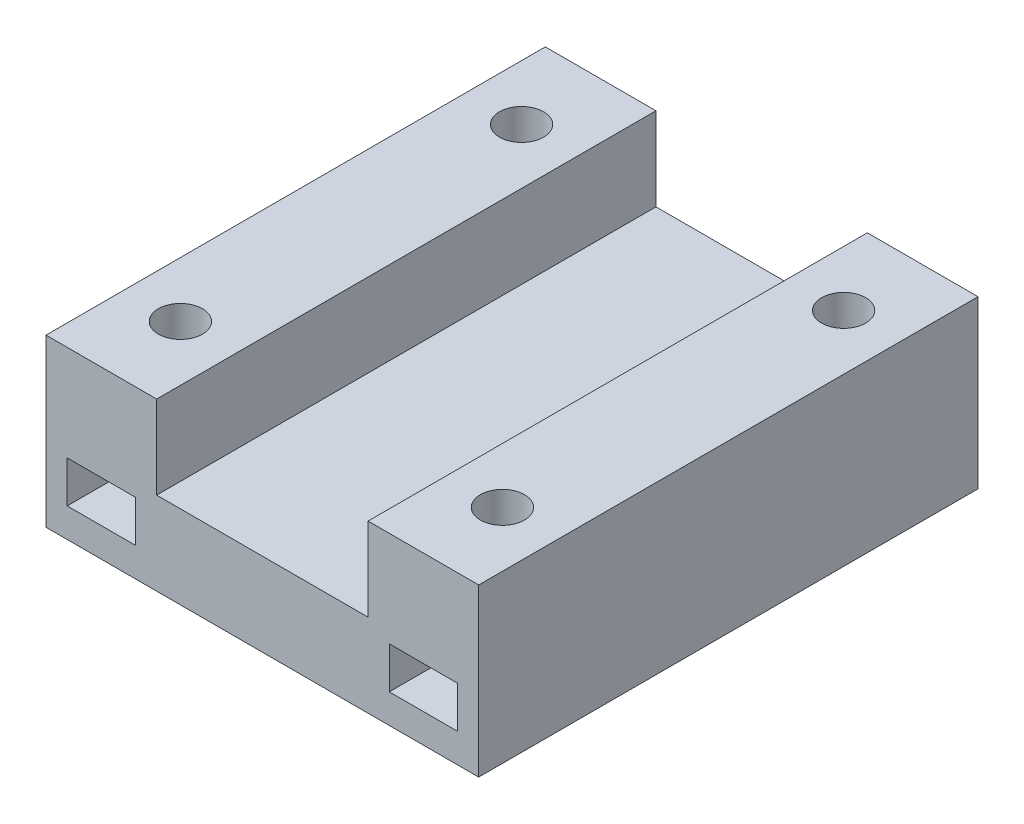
ISO-10303-21;
HEADER;
FILE_DESCRIPTION(('STEP AP214'),'2;1');
FILE_NAME('part.step','',(''),(''),'','','');
FILE_SCHEMA(('AUTOMOTIVE_DESIGN { 1 0 10303 214 1 1 1 1 }'));
ENDSEC;
DATA;
#1=APPLICATION_CONTEXT('core data for automotive mechanical design processes');
#2=APPLICATION_PROTOCOL_DEFINITION('international standard','automotive_design',2000,#1);
#3=PRODUCT_CONTEXT('',#1,'mechanical');
#4=PRODUCT('Part','Part','',(#3));
#5=PRODUCT_RELATED_PRODUCT_CATEGORY('part','',(#4));
#6=PRODUCT_DEFINITION_FORMATION('','',#4);
#7=PRODUCT_DEFINITION_CONTEXT('part definition',#1,'design');
#8=PRODUCT_DEFINITION('design','',#6,#7);
#9=PRODUCT_DEFINITION_SHAPE('','',#8);
#10=(LENGTH_UNIT() NAMED_UNIT(*) SI_UNIT(.MILLI.,.METRE.));
#11=(NAMED_UNIT(*) PLANE_ANGLE_UNIT() SI_UNIT($,.RADIAN.));
#12=(NAMED_UNIT(*) SI_UNIT($,.STERADIAN.) SOLID_ANGLE_UNIT());
#13=UNCERTAINTY_MEASURE_WITH_UNIT(LENGTH_MEASURE(1.E-05),#10,'distance_accuracy_value','');
#14=(GEOMETRIC_REPRESENTATION_CONTEXT(3) GLOBAL_UNCERTAINTY_ASSIGNED_CONTEXT((#13)) GLOBAL_UNIT_ASSIGNED_CONTEXT((#10,
#11,#12)) REPRESENTATION_CONTEXT('',''));
#15=CARTESIAN_POINT('',(0.,0.,0.));
#16=DIRECTION('',(0.,0.,1.));
#17=DIRECTION('',(1.,0.,0.));
#18=AXIS2_PLACEMENT_3D('',#15,#16,#17);
#19=CARTESIAN_POINT('',(-19.35,7.49999999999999,50.5));
#20=DIRECTION('',(0.,1.,0.));
#21=DIRECTION('',(-1.,0.,0.));
#22=AXIS2_PLACEMENT_3D('',#19,#20,#21);
#23=CYLINDRICAL_SURFACE('',#22,2.65);
#24=CARTESIAN_POINT('',(-19.35,21.,50.5));
#25=DIRECTION('',(0.,-1.,0.));
#26=DIRECTION('',(1.,0.,0.));
#27=AXIS2_PLACEMENT_3D('',#24,#25,#26);
#28=CIRCLE('',#27,2.65);
#29=CARTESIAN_POINT('',(-22.,21.,50.5));
#30=VERTEX_POINT('',#29);
#31=EDGE_CURVE('E365',#30,#30,#28,.F.);
#32=CARTESIAN_POINT('',(-19.35,17.5,50.5));
#33=DIRECTION('',(0.,-1.,0.));
#34=DIRECTION('',(0.,0.,-1.));
#35=AXIS2_PLACEMENT_3D('',#32,#33,#34);
#36=CIRCLE('',#35,2.65);
#37=CARTESIAN_POINT('',(-22.,17.5,50.5));
#38=VERTEX_POINT('',#37);
#39=EDGE_CURVE('E517',#38,#38,#36,.F.);
#40=CARTESIAN_POINT('',(-22.,21.,50.5));
#41=CARTESIAN_POINT('',(-22.,20.9635416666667,50.5));
#42=CARTESIAN_POINT('',(-22.,20.9270833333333,50.5));
#43=CARTESIAN_POINT('',(-22.,20.8541666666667,50.5));
#44=CARTESIAN_POINT('',(-22.,20.8177083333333,50.5));
#45=CARTESIAN_POINT('',(-22.,20.7447916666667,50.5));
#46=CARTESIAN_POINT('',(-22.,20.7083333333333,50.5));
#47=CARTESIAN_POINT('',(-22.,20.6354166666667,50.5));
#48=CARTESIAN_POINT('',(-22.,20.5989583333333,50.5));
#49=CARTESIAN_POINT('',(-22.,20.5260416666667,50.5));
#50=CARTESIAN_POINT('',(-22.,20.4895833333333,50.5));
#51=CARTESIAN_POINT('',(-22.,20.4166666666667,50.5));
#52=CARTESIAN_POINT('',(-22.,20.3802083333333,50.5));
#53=CARTESIAN_POINT('',(-22.,20.3072916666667,50.5));
#54=CARTESIAN_POINT('',(-22.,20.2708333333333,50.5));
#55=CARTESIAN_POINT('',(-22.,20.1979166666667,50.5));
#56=CARTESIAN_POINT('',(-22.,20.1614583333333,50.5));
#57=CARTESIAN_POINT('',(-22.,20.0885416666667,50.5));
#58=CARTESIAN_POINT('',(-22.,20.0520833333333,50.5));
#59=CARTESIAN_POINT('',(-22.,19.9791666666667,50.5));
#60=CARTESIAN_POINT('',(-22.,19.9427083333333,50.5));
#61=CARTESIAN_POINT('',(-22.,19.8697916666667,50.5));
#62=CARTESIAN_POINT('',(-22.,19.8333333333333,50.5));
#63=CARTESIAN_POINT('',(-22.,19.7604166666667,50.5));
#64=CARTESIAN_POINT('',(-22.,19.7239583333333,50.5));
#65=CARTESIAN_POINT('',(-22.,19.6510416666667,50.5));
#66=CARTESIAN_POINT('',(-22.,19.6145833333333,50.5));
#67=CARTESIAN_POINT('',(-22.,19.5416666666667,50.5));
#68=CARTESIAN_POINT('',(-22.,19.5052083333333,50.5));
#69=CARTESIAN_POINT('',(-22.,19.4322916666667,50.5));
#70=CARTESIAN_POINT('',(-22.,19.3958333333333,50.5));
#71=CARTESIAN_POINT('',(-22.,19.3229166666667,50.5));
#72=CARTESIAN_POINT('',(-22.,19.2864583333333,50.5));
#73=CARTESIAN_POINT('',(-22.,19.2135416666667,50.5));
#74=CARTESIAN_POINT('',(-22.,19.1770833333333,50.5));
#75=CARTESIAN_POINT('',(-22.,19.1041666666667,50.5));
#76=CARTESIAN_POINT('',(-22.,19.0677083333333,50.5));
#77=CARTESIAN_POINT('',(-22.,18.9947916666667,50.5));
#78=CARTESIAN_POINT('',(-22.,18.9583333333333,50.5));
#79=CARTESIAN_POINT('',(-22.,18.8854166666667,50.5));
#80=CARTESIAN_POINT('',(-22.,18.8489583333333,50.5));
#81=CARTESIAN_POINT('',(-22.,18.7760416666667,50.5));
#82=CARTESIAN_POINT('',(-22.,18.7395833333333,50.5));
#83=CARTESIAN_POINT('',(-22.,18.6666666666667,50.5));
#84=CARTESIAN_POINT('',(-22.,18.6302083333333,50.5));
#85=CARTESIAN_POINT('',(-22.,18.5572916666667,50.5));
#86=CARTESIAN_POINT('',(-22.,18.5208333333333,50.5));
#87=CARTESIAN_POINT('',(-22.,18.4479166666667,50.5));
#88=CARTESIAN_POINT('',(-22.,18.4114583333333,50.5));
#89=CARTESIAN_POINT('',(-22.,18.3385416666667,50.5));
#90=CARTESIAN_POINT('',(-22.,18.3020833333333,50.5));
#91=CARTESIAN_POINT('',(-22.,18.2291666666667,50.5));
#92=CARTESIAN_POINT('',(-22.,18.1927083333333,50.5));
#93=CARTESIAN_POINT('',(-22.,18.1197916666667,50.5));
#94=CARTESIAN_POINT('',(-22.,18.0833333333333,50.5));
#95=CARTESIAN_POINT('',(-22.,18.0104166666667,50.5));
#96=CARTESIAN_POINT('',(-22.,17.9739583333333,50.5));
#97=CARTESIAN_POINT('',(-22.,17.9010416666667,50.5));
#98=CARTESIAN_POINT('',(-22.,17.8645833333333,50.5));
#99=CARTESIAN_POINT('',(-22.,17.7916666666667,50.5));
#100=CARTESIAN_POINT('',(-22.,17.7552083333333,50.5));
#101=CARTESIAN_POINT('',(-22.,17.6822916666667,50.5));
#102=CARTESIAN_POINT('',(-22.,17.6458333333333,50.5));
#103=CARTESIAN_POINT('',(-22.,17.5729166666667,50.5));
#104=CARTESIAN_POINT('',(-22.,17.5364583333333,50.5));
#105=CARTESIAN_POINT('',(-22.,17.5,50.5));
#106=B_SPLINE_CURVE_WITH_KNOTS('',3,(#40,#41,#42,#43,#44,#45,#46,#47,#48,#49,#50,#51,#52,#53,
#54,#55,#56,#57,#58,#59,#60,#61,#62,#63,#64,#65,#66,#67,#68,#69,#70,#71,#72,#73,#74,#75,#76,#77,
#78,#79,#80,#81,#82,#83,#84,#85,#86,#87,#88,#89,#90,#91,#92,#93,#94,#95,#96,#97,#98,#99,#100,
#101,#102,#103,#104,#105),.UNSPECIFIED.,.F.,.F.,(4,2,2,2,2,2,2,2,2,2,2,2,2,2,2,2,2,2,2,2,2,2,2,
2,2,2,2,2,2,2,2,2,4),(0.,0.109374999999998,0.21875,0.328125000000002,0.4375,0.546874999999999,
0.656250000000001,0.765624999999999,0.874999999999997,0.984374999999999,1.09375,1.203125,1.3125,
1.421875,1.53125,1.640625,1.75,1.859375,1.96875,2.078125,2.1875,2.296875,2.40625,2.515625,2.625,
2.734375,2.84375,2.953125,3.0625,3.171875,3.28125,3.390625,3.5),.UNSPECIFIED.);
#107=EDGE_CURVE('BSEAM38',#30,#38,#106,.T.);
#108=ORIENTED_EDGE('',*,*,#31,.T.);
#109=ORIENTED_EDGE('',*,*,#39,.F.);
#110=ORIENTED_EDGE('',*,*,#107,.T.);
#111=ORIENTED_EDGE('',*,*,#107,.F.);
#112=EDGE_LOOP('',(#108,#110,#109,#111));
#113=FACE_BOUND('',#112,.T.);
#114=ADVANCED_FACE('F38',(#113),#23,.F.);
#115=CARTESIAN_POINT('',(0.,0.,0.));
#116=DIRECTION('',(0.,0.,1.));
#117=DIRECTION('',(1.,0.,0.));
#118=AXIS2_PLACEMENT_3D('',#115,#116,#117);
#119=PLANE('',#118);
#120=DIRECTION('',(-1.,0.,0.));
#121=VECTOR('',#120,1.);
#122=CARTESIAN_POINT('',(-15.25,21.,0.));
#123=LINE('',#122,#121);
#124=CARTESIAN_POINT('',(-15.25,21.,0.));
#125=VERTEX_POINT('',#124);
#126=CARTESIAN_POINT('',(-23.45,21.,0.));
#127=VERTEX_POINT('',#126);
#128=EDGE_CURVE('E458',#125,#127,#123,.T.);
#129=ORIENTED_EDGE('',*,*,#128,.F.);
#130=DIRECTION('',(0.,-1.,0.));
#131=VECTOR('',#130,1.);
#132=CARTESIAN_POINT('',(-15.25,26.,0.));
#133=LINE('',#132,#131);
#134=CARTESIAN_POINT('',(-15.25,26.,0.));
#135=VERTEX_POINT('',#134);
#136=EDGE_CURVE('E368',#135,#125,#133,.T.);
#137=ORIENTED_EDGE('',*,*,#136,.F.);
#138=DIRECTION('',(1.,0.,0.));
#139=VECTOR('',#138,1.);
#140=CARTESIAN_POINT('',(-15.25,26.,0.));
#141=LINE('',#140,#139);
#142=CARTESIAN_POINT('',(-23.45,26.,0.));
#143=VERTEX_POINT('',#142);
#144=EDGE_CURVE('E445',#143,#135,#141,.T.);
#145=ORIENTED_EDGE('',*,*,#144,.F.);
#146=DIRECTION('',(0.,1.,0.));
#147=VECTOR('',#146,1.);
#148=CARTESIAN_POINT('',(-23.45,26.,0.));
#149=LINE('',#148,#147);
#150=EDGE_CURVE('E461',#127,#143,#149,.T.);
#151=ORIENTED_EDGE('',*,*,#150,.F.);
#152=EDGE_LOOP('',(#129,#137,#145,#151));
#153=FACE_BOUND('',#152,.T.);
#154=DIRECTION('',(-1.,0.,0.));
#155=VECTOR('',#154,1.);
#156=CARTESIAN_POINT('',(15.25,21.,0.));
#157=LINE('',#156,#155);
#158=CARTESIAN_POINT('',(23.45,21.,0.));
#159=VERTEX_POINT('',#158);
#160=CARTESIAN_POINT('',(15.25,21.,0.));
#161=VERTEX_POINT('',#160);
#162=EDGE_CURVE('E425',#159,#161,#157,.T.);
#163=ORIENTED_EDGE('',*,*,#162,.F.);
#164=DIRECTION('',(0.,-1.,0.));
#165=VECTOR('',#164,1.);
#166=CARTESIAN_POINT('',(23.45,26.,0.));
#167=LINE('',#166,#165);
#168=CARTESIAN_POINT('',(23.45,26.,0.));
#169=VERTEX_POINT('',#168);
#170=EDGE_CURVE('E422',#169,#159,#167,.T.);
#171=ORIENTED_EDGE('',*,*,#170,.F.);
#172=DIRECTION('',(1.,0.,0.));
#173=VECTOR('',#172,1.);
#174=CARTESIAN_POINT('',(15.25,26.,0.));
#175=LINE('',#174,#173);
#176=CARTESIAN_POINT('',(15.25,26.,0.));
#177=VERTEX_POINT('',#176);
#178=EDGE_CURVE('E432',#177,#169,#175,.T.);
#179=ORIENTED_EDGE('',*,*,#178,.F.);
#180=DIRECTION('',(0.,1.,0.));
#181=VECTOR('',#180,1.);
#182=CARTESIAN_POINT('',(15.25,26.,0.));
#183=LINE('',#182,#181);
#184=EDGE_CURVE('E429',#161,#177,#183,.T.);
#185=ORIENTED_EDGE('',*,*,#184,.F.);
#186=EDGE_LOOP('',(#163,#171,#179,#185));
#187=FACE_BOUND('',#186,.T.);
#188=DIRECTION('',(0.,1.,0.));
#189=VECTOR('',#188,1.);
#190=CARTESIAN_POINT('',(26.,17.5,0.));
#191=LINE('',#190,#189);
#192=CARTESIAN_POINT('',(26.,17.5,0.));
#193=VERTEX_POINT('',#192);
#194=CARTESIAN_POINT('',(26.,37.5,0.));
#195=VERTEX_POINT('',#194);
#196=EDGE_CURVE('E502',#193,#195,#191,.T.);
#197=ORIENTED_EDGE('',*,*,#196,.F.);
#198=DIRECTION('',(1.,0.,0.));
#199=VECTOR('',#198,1.);
#200=CARTESIAN_POINT('',(-26.,17.5,0.));
#201=LINE('',#200,#199);
#202=CARTESIAN_POINT('',(-26.,17.5,0.));
#203=VERTEX_POINT('',#202);
#204=EDGE_CURVE('E293',#203,#193,#201,.T.);
#205=ORIENTED_EDGE('',*,*,#204,.F.);
#206=DIRECTION('',(0.,-1.,0.));
#207=VECTOR('',#206,1.);
#208=CARTESIAN_POINT('',(-26.,37.5,0.));
#209=LINE('',#208,#207);
#210=CARTESIAN_POINT('',(-26.,37.5,0.));
#211=VERTEX_POINT('',#210);
#212=EDGE_CURVE('E276',#211,#203,#209,.T.);
#213=ORIENTED_EDGE('',*,*,#212,.F.);
#214=DIRECTION('',(-1.,0.,0.));
#215=VECTOR('',#214,1.);
#216=CARTESIAN_POINT('',(-37.5,37.5,0.));
#217=LINE('',#216,#215);
#218=CARTESIAN_POINT('',(-12.7,37.5,0.));
#219=VERTEX_POINT('',#218);
#220=EDGE_CURVE('E291',#219,#211,#217,.T.);
#221=ORIENTED_EDGE('',*,*,#220,.F.);
#222=DIRECTION('',(0.,-1.,0.));
#223=VECTOR('',#222,1.);
#224=CARTESIAN_POINT('',(-12.7,37.5,0.));
#225=LINE('',#224,#223);
#226=CARTESIAN_POINT('',(-12.7,27.5,0.));
#227=VERTEX_POINT('',#226);
#228=EDGE_CURVE('E300',#219,#227,#225,.T.);
#229=ORIENTED_EDGE('',*,*,#228,.T.);
#230=DIRECTION('',(-1.,0.,0.));
#231=VECTOR('',#230,1.);
#232=CARTESIAN_POINT('',(37.5,27.5,0.));
#233=LINE('',#232,#231);
#234=CARTESIAN_POINT('',(12.7,27.5,0.));
#235=VERTEX_POINT('',#234);
#236=EDGE_CURVE('E334',#235,#227,#233,.T.);
#237=ORIENTED_EDGE('',*,*,#236,.F.);
#238=DIRECTION('',(0.,-1.,0.));
#239=VECTOR('',#238,1.);
#240=CARTESIAN_POINT('',(12.7,37.5,0.));
#241=LINE('',#240,#239);
#242=CARTESIAN_POINT('',(12.7,37.5,0.));
#243=VERTEX_POINT('',#242);
#244=EDGE_CURVE('E325',#243,#235,#241,.T.);
#245=ORIENTED_EDGE('',*,*,#244,.F.);
#246=DIRECTION('',(-1.,0.,0.));
#247=VECTOR('',#246,1.);
#248=CARTESIAN_POINT('',(12.7,37.5,0.));
#249=LINE('',#248,#247);
#250=EDGE_CURVE('E311',#195,#243,#249,.T.);
#251=ORIENTED_EDGE('',*,*,#250,.F.);
#252=EDGE_LOOP('',(#197,#205,#213,#221,#229,#237,#245,#251));
#253=FACE_BOUND('',#252,.T.);
#254=ADVANCED_FACE('F289',(#153,#187,#253),#119,.F.);
#255=CARTESIAN_POINT('',(-26.,27.5,60.));
#256=DIRECTION('',(1.,0.,0.));
#257=DIRECTION('',(0.,0.,-1.));
#258=AXIS2_PLACEMENT_3D('',#255,#256,#257);
#259=PLANE('',#258);
#260=DIRECTION('',(0.,0.,1.));
#261=VECTOR('',#260,1.);
#262=CARTESIAN_POINT('',(-26.,17.5,0.));
#263=LINE('',#262,#261);
#264=CARTESIAN_POINT('',(-26.,17.5,60.));
#265=VERTEX_POINT('',#264);
#266=EDGE_CURVE('E505',#203,#265,#263,.T.);
#267=ORIENTED_EDGE('',*,*,#266,.T.);
#268=DIRECTION('',(0.,-1.,0.));
#269=VECTOR('',#268,1.);
#270=CARTESIAN_POINT('',(-26.,27.5,60.));
#271=LINE('',#270,#269);
#272=CARTESIAN_POINT('',(-26.,37.5,60.));
#273=VERTEX_POINT('',#272);
#274=EDGE_CURVE('E279',#273,#265,#271,.T.);
#275=ORIENTED_EDGE('',*,*,#274,.F.);
#276=DIRECTION('',(0.,0.,1.));
#277=VECTOR('',#276,1.);
#278=CARTESIAN_POINT('',(-26.,37.5,20.));
#279=LINE('',#278,#277);
#280=EDGE_CURVE('E273',#211,#273,#279,.T.);
#281=ORIENTED_EDGE('',*,*,#280,.F.);
#282=ORIENTED_EDGE('',*,*,#212,.T.);
#283=EDGE_LOOP('',(#267,#275,#281,#282));
#284=FACE_BOUND('',#283,.T.);
#285=ADVANCED_FACE('F275',(#284),#259,.F.);
#286=CARTESIAN_POINT('',(26.,27.5,60.));
#287=DIRECTION('',(-1.,0.,0.));
#288=DIRECTION('',(0.,0.,1.));
#289=AXIS2_PLACEMENT_3D('',#286,#287,#288);
#290=PLANE('',#289);
#291=DIRECTION('',(0.,0.,1.));
#292=VECTOR('',#291,1.);
#293=CARTESIAN_POINT('',(26.,17.5,0.));
#294=LINE('',#293,#292);
#295=CARTESIAN_POINT('',(26.,17.5,60.));
#296=VERTEX_POINT('',#295);
#297=EDGE_CURVE('E504',#193,#296,#294,.T.);
#298=ORIENTED_EDGE('',*,*,#297,.F.);
#299=ORIENTED_EDGE('',*,*,#196,.T.);
#300=DIRECTION('',(0.,0.,-1.));
#301=VECTOR('',#300,1.);
#302=CARTESIAN_POINT('',(26.,37.5,60.));
#303=LINE('',#302,#301);
#304=CARTESIAN_POINT('',(26.,37.5,60.));
#305=VERTEX_POINT('',#304);
#306=EDGE_CURVE('E318',#305,#195,#303,.T.);
#307=ORIENTED_EDGE('',*,*,#306,.F.);
#308=DIRECTION('',(0.,1.,0.));
#309=VECTOR('',#308,1.);
#310=CARTESIAN_POINT('',(26.,27.5,60.));
#311=LINE('',#310,#309);
#312=EDGE_CURVE('E329',#296,#305,#311,.T.);
#313=ORIENTED_EDGE('',*,*,#312,.F.);
#314=EDGE_LOOP('',(#298,#299,#307,#313));
#315=FACE_BOUND('',#314,.T.);
#316=ADVANCED_FACE('F501',(#315),#290,.F.);
#317=CARTESIAN_POINT('',(19.35,7.49999999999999,50.5));
#318=DIRECTION('',(0.,1.,0.));
#319=DIRECTION('',(-1.,0.,0.));
#320=AXIS2_PLACEMENT_3D('',#317,#318,#319);
#321=CYLINDRICAL_SURFACE('',#320,2.65);
#322=CARTESIAN_POINT('',(19.35,21.,50.5));
#323=DIRECTION('',(0.,-1.,0.));
#324=DIRECTION('',(1.,0.,0.));
#325=AXIS2_PLACEMENT_3D('',#322,#323,#324);
#326=CIRCLE('',#325,2.65);
#327=CARTESIAN_POINT('',(16.7,21.,50.5));
#328=VERTEX_POINT('',#327);
#329=EDGE_CURVE('E355',#328,#328,#326,.F.);
#330=CARTESIAN_POINT('',(19.35,17.5,50.5));
#331=DIRECTION('',(0.,-1.,0.));
#332=DIRECTION('',(0.,0.,-1.));
#333=AXIS2_PLACEMENT_3D('',#330,#331,#332);
#334=CIRCLE('',#333,2.65);
#335=CARTESIAN_POINT('',(16.7,17.5,50.5));
#336=VERTEX_POINT('',#335);
#337=EDGE_CURVE('E514',#336,#336,#334,.F.);
#338=CARTESIAN_POINT('',(16.7,21.,50.5));
#339=CARTESIAN_POINT('',(16.7,20.9635416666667,50.5));
#340=CARTESIAN_POINT('',(16.7,20.9270833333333,50.5));
#341=CARTESIAN_POINT('',(16.7,20.8541666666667,50.5));
#342=CARTESIAN_POINT('',(16.7,20.8177083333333,50.5));
#343=CARTESIAN_POINT('',(16.7,20.7447916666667,50.5));
#344=CARTESIAN_POINT('',(16.7,20.7083333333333,50.5));
#345=CARTESIAN_POINT('',(16.7,20.6354166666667,50.5));
#346=CARTESIAN_POINT('',(16.7,20.5989583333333,50.5));
#347=CARTESIAN_POINT('',(16.7,20.5260416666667,50.5));
#348=CARTESIAN_POINT('',(16.7,20.4895833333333,50.5));
#349=CARTESIAN_POINT('',(16.7,20.4166666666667,50.5));
#350=CARTESIAN_POINT('',(16.7,20.3802083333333,50.5));
#351=CARTESIAN_POINT('',(16.7,20.3072916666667,50.5));
#352=CARTESIAN_POINT('',(16.7,20.2708333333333,50.5));
#353=CARTESIAN_POINT('',(16.7,20.1979166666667,50.5));
#354=CARTESIAN_POINT('',(16.7,20.1614583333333,50.5));
#355=CARTESIAN_POINT('',(16.7,20.0885416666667,50.5));
#356=CARTESIAN_POINT('',(16.7,20.0520833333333,50.5));
#357=CARTESIAN_POINT('',(16.7,19.9791666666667,50.5));
#358=CARTESIAN_POINT('',(16.7,19.9427083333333,50.5));
#359=CARTESIAN_POINT('',(16.7,19.8697916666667,50.5));
#360=CARTESIAN_POINT('',(16.7,19.8333333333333,50.5));
#361=CARTESIAN_POINT('',(16.7,19.7604166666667,50.5));
#362=CARTESIAN_POINT('',(16.7,19.7239583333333,50.5));
#363=CARTESIAN_POINT('',(16.7,19.6510416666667,50.5));
#364=CARTESIAN_POINT('',(16.7,19.6145833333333,50.5));
#365=CARTESIAN_POINT('',(16.7,19.5416666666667,50.5));
#366=CARTESIAN_POINT('',(16.7,19.5052083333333,50.5));
#367=CARTESIAN_POINT('',(16.7,19.4322916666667,50.5));
#368=CARTESIAN_POINT('',(16.7,19.3958333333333,50.5));
#369=CARTESIAN_POINT('',(16.7,19.3229166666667,50.5));
#370=CARTESIAN_POINT('',(16.7,19.2864583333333,50.5));
#371=CARTESIAN_POINT('',(16.7,19.2135416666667,50.5));
#372=CARTESIAN_POINT('',(16.7,19.1770833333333,50.5));
#373=CARTESIAN_POINT('',(16.7,19.1041666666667,50.5));
#374=CARTESIAN_POINT('',(16.7,19.0677083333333,50.5));
#375=CARTESIAN_POINT('',(16.7,18.9947916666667,50.5));
#376=CARTESIAN_POINT('',(16.7,18.9583333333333,50.5));
#377=CARTESIAN_POINT('',(16.7,18.8854166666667,50.5));
#378=CARTESIAN_POINT('',(16.7,18.8489583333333,50.5));
#379=CARTESIAN_POINT('',(16.7,18.7760416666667,50.5));
#380=CARTESIAN_POINT('',(16.7,18.7395833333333,50.5));
#381=CARTESIAN_POINT('',(16.7,18.6666666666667,50.5));
#382=CARTESIAN_POINT('',(16.7,18.6302083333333,50.5));
#383=CARTESIAN_POINT('',(16.7,18.5572916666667,50.5));
#384=CARTESIAN_POINT('',(16.7,18.5208333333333,50.5));
#385=CARTESIAN_POINT('',(16.7,18.4479166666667,50.5));
#386=CARTESIAN_POINT('',(16.7,18.4114583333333,50.5));
#387=CARTESIAN_POINT('',(16.7,18.3385416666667,50.5));
#388=CARTESIAN_POINT('',(16.7,18.3020833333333,50.5));
#389=CARTESIAN_POINT('',(16.7,18.2291666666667,50.5));
#390=CARTESIAN_POINT('',(16.7,18.1927083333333,50.5));
#391=CARTESIAN_POINT('',(16.7,18.1197916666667,50.5));
#392=CARTESIAN_POINT('',(16.7,18.0833333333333,50.5));
#393=CARTESIAN_POINT('',(16.7,18.0104166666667,50.5));
#394=CARTESIAN_POINT('',(16.7,17.9739583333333,50.5));
#395=CARTESIAN_POINT('',(16.7,17.9010416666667,50.5));
#396=CARTESIAN_POINT('',(16.7,17.8645833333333,50.5));
#397=CARTESIAN_POINT('',(16.7,17.7916666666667,50.5));
#398=CARTESIAN_POINT('',(16.7,17.7552083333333,50.5));
#399=CARTESIAN_POINT('',(16.7,17.6822916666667,50.5));
#400=CARTESIAN_POINT('',(16.7,17.6458333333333,50.5));
#401=CARTESIAN_POINT('',(16.7,17.5729166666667,50.5));
#402=CARTESIAN_POINT('',(16.7,17.5364583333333,50.5));
#403=CARTESIAN_POINT('',(16.7,17.5,50.5));
#404=B_SPLINE_CURVE_WITH_KNOTS('',3,(#338,#339,#340,#341,#342,#343,#344,#345,#346,#347,#348,
#349,#350,#351,#352,#353,#354,#355,#356,#357,#358,#359,#360,#361,#362,#363,#364,#365,#366,#367,
#368,#369,#370,#371,#372,#373,#374,#375,#376,#377,#378,#379,#380,#381,#382,#383,#384,#385,#386,
#387,#388,#389,#390,#391,#392,#393,#394,#395,#396,#397,#398,#399,#400,#401,#402,#403),
.UNSPECIFIED.,.F.,.F.,(4,2,2,2,2,2,2,2,2,2,2,2,2,2,2,2,2,2,2,2,2,2,2,2,2,2,2,2,2,2,2,2,4),(0.,
0.109374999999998,0.21875,0.328124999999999,0.437499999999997,0.546874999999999,
0.656249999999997,0.765624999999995,0.874999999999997,0.984374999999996,1.09374999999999,
1.203125,1.31249999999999,1.42187499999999,1.53124999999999,1.64062499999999,1.74999999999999,
1.85937499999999,1.96874999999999,2.07812499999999,2.18749999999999,2.29687499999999,
2.40624999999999,2.51562499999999,2.62499999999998,2.73437499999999,2.84374999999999,
2.95312499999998,3.06249999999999,3.17187499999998,3.28124999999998,3.39062499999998,
3.49999999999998),.UNSPECIFIED.);
#405=EDGE_CURVE('BSEAM714',#328,#336,#404,.T.);
#406=ORIENTED_EDGE('',*,*,#329,.T.);
#407=ORIENTED_EDGE('',*,*,#337,.F.);
#408=ORIENTED_EDGE('',*,*,#405,.T.);
#409=ORIENTED_EDGE('',*,*,#405,.F.);
#410=EDGE_LOOP('',(#406,#408,#407,#409));
#411=FACE_BOUND('',#410,.T.);
#412=ADVANCED_FACE('F714',(#411),#321,.F.);
#413=CARTESIAN_POINT('',(19.35,7.49999999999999,9.5));
#414=DIRECTION('',(0.,1.,0.));
#415=DIRECTION('',(-1.,0.,0.));
#416=AXIS2_PLACEMENT_3D('',#413,#414,#415);
#417=CYLINDRICAL_SURFACE('',#416,2.65);
#418=CARTESIAN_POINT('',(19.35,21.,9.5));
#419=DIRECTION('',(0.,-1.,0.));
#420=DIRECTION('',(1.,0.,0.));
#421=AXIS2_PLACEMENT_3D('',#418,#419,#420);
#422=CIRCLE('',#421,2.65);
#423=CARTESIAN_POINT('',(16.7,21.,9.5));
#424=VERTEX_POINT('',#423);
#425=EDGE_CURVE('E341',#424,#424,#422,.F.);
#426=CARTESIAN_POINT('',(19.35,17.5,9.5));
#427=DIRECTION('',(0.,-1.,0.));
#428=DIRECTION('',(0.,0.,-1.));
#429=AXIS2_PLACEMENT_3D('',#426,#427,#428);
#430=CIRCLE('',#429,2.65);
#431=CARTESIAN_POINT('',(16.7,17.5,9.5));
#432=VERTEX_POINT('',#431);
#433=EDGE_CURVE('E511',#432,#432,#430,.F.);
#434=CARTESIAN_POINT('',(16.7,21.,9.5));
#435=CARTESIAN_POINT('',(16.7,20.9635416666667,9.5));
#436=CARTESIAN_POINT('',(16.7,20.9270833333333,9.5));
#437=CARTESIAN_POINT('',(16.7,20.8541666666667,9.5));
#438=CARTESIAN_POINT('',(16.7,20.8177083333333,9.5));
#439=CARTESIAN_POINT('',(16.7,20.7447916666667,9.5));
#440=CARTESIAN_POINT('',(16.7,20.7083333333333,9.5));
#441=CARTESIAN_POINT('',(16.7,20.6354166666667,9.5));
#442=CARTESIAN_POINT('',(16.7,20.5989583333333,9.5));
#443=CARTESIAN_POINT('',(16.7,20.5260416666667,9.5));
#444=CARTESIAN_POINT('',(16.7,20.4895833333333,9.5));
#445=CARTESIAN_POINT('',(16.7,20.4166666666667,9.5));
#446=CARTESIAN_POINT('',(16.7,20.3802083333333,9.5));
#447=CARTESIAN_POINT('',(16.7,20.3072916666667,9.5));
#448=CARTESIAN_POINT('',(16.7,20.2708333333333,9.5));
#449=CARTESIAN_POINT('',(16.7,20.1979166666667,9.5));
#450=CARTESIAN_POINT('',(16.7,20.1614583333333,9.5));
#451=CARTESIAN_POINT('',(16.7,20.0885416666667,9.5));
#452=CARTESIAN_POINT('',(16.7,20.0520833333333,9.5));
#453=CARTESIAN_POINT('',(16.7,19.9791666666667,9.5));
#454=CARTESIAN_POINT('',(16.7,19.9427083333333,9.5));
#455=CARTESIAN_POINT('',(16.7,19.8697916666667,9.5));
#456=CARTESIAN_POINT('',(16.7,19.8333333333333,9.5));
#457=CARTESIAN_POINT('',(16.7,19.7604166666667,9.5));
#458=CARTESIAN_POINT('',(16.7,19.7239583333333,9.5));
#459=CARTESIAN_POINT('',(16.7,19.6510416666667,9.5));
#460=CARTESIAN_POINT('',(16.7,19.6145833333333,9.5));
#461=CARTESIAN_POINT('',(16.7,19.5416666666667,9.5));
#462=CARTESIAN_POINT('',(16.7,19.5052083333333,9.5));
#463=CARTESIAN_POINT('',(16.7,19.4322916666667,9.5));
#464=CARTESIAN_POINT('',(16.7,19.3958333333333,9.5));
#465=CARTESIAN_POINT('',(16.7,19.3229166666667,9.5));
#466=CARTESIAN_POINT('',(16.7,19.2864583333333,9.5));
#467=CARTESIAN_POINT('',(16.7,19.2135416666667,9.5));
#468=CARTESIAN_POINT('',(16.7,19.1770833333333,9.5));
#469=CARTESIAN_POINT('',(16.7,19.1041666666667,9.5));
#470=CARTESIAN_POINT('',(16.7,19.0677083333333,9.5));
#471=CARTESIAN_POINT('',(16.7,18.9947916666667,9.5));
#472=CARTESIAN_POINT('',(16.7,18.9583333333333,9.5));
#473=CARTESIAN_POINT('',(16.7,18.8854166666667,9.5));
#474=CARTESIAN_POINT('',(16.7,18.8489583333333,9.5));
#475=CARTESIAN_POINT('',(16.7,18.7760416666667,9.5));
#476=CARTESIAN_POINT('',(16.7,18.7395833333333,9.5));
#477=CARTESIAN_POINT('',(16.7,18.6666666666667,9.5));
#478=CARTESIAN_POINT('',(16.7,18.6302083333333,9.5));
#479=CARTESIAN_POINT('',(16.7,18.5572916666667,9.5));
#480=CARTESIAN_POINT('',(16.7,18.5208333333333,9.5));
#481=CARTESIAN_POINT('',(16.7,18.4479166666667,9.5));
#482=CARTESIAN_POINT('',(16.7,18.4114583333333,9.5));
#483=CARTESIAN_POINT('',(16.7,18.3385416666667,9.5));
#484=CARTESIAN_POINT('',(16.7,18.3020833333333,9.5));
#485=CARTESIAN_POINT('',(16.7,18.2291666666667,9.5));
#486=CARTESIAN_POINT('',(16.7,18.1927083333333,9.5));
#487=CARTESIAN_POINT('',(16.7,18.1197916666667,9.5));
#488=CARTESIAN_POINT('',(16.7,18.0833333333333,9.5));
#489=CARTESIAN_POINT('',(16.7,18.0104166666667,9.5));
#490=CARTESIAN_POINT('',(16.7,17.9739583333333,9.5));
#491=CARTESIAN_POINT('',(16.7,17.9010416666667,9.5));
#492=CARTESIAN_POINT('',(16.7,17.8645833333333,9.5));
#493=CARTESIAN_POINT('',(16.7,17.7916666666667,9.5));
#494=CARTESIAN_POINT('',(16.7,17.7552083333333,9.5));
#495=CARTESIAN_POINT('',(16.7,17.6822916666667,9.5));
#496=CARTESIAN_POINT('',(16.7,17.6458333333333,9.5));
#497=CARTESIAN_POINT('',(16.7,17.5729166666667,9.5));
#498=CARTESIAN_POINT('',(16.7,17.5364583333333,9.5));
#499=CARTESIAN_POINT('',(16.7,17.5,9.5));
#500=B_SPLINE_CURVE_WITH_KNOTS('',3,(#434,#435,#436,#437,#438,#439,#440,#441,#442,#443,#444,
#445,#446,#447,#448,#449,#450,#451,#452,#453,#454,#455,#456,#457,#458,#459,#460,#461,#462,#463,
#464,#465,#466,#467,#468,#469,#470,#471,#472,#473,#474,#475,#476,#477,#478,#479,#480,#481,#482,
#483,#484,#485,#486,#487,#488,#489,#490,#491,#492,#493,#494,#495,#496,#497,#498,#499),
.UNSPECIFIED.,.F.,.F.,(4,2,2,2,2,2,2,2,2,2,2,2,2,2,2,2,2,2,2,2,2,2,2,2,2,2,2,2,2,2,2,2,4),(0.,
0.109374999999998,0.21875,0.328124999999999,0.437499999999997,0.546874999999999,
0.656249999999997,0.765624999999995,0.874999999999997,0.984374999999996,1.09374999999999,
1.203125,1.31249999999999,1.42187499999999,1.53124999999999,1.64062499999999,1.74999999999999,
1.85937499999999,1.96874999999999,2.07812499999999,2.18749999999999,2.29687499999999,
2.40624999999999,2.51562499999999,2.62499999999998,2.73437499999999,2.84374999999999,
2.95312499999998,3.06249999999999,3.17187499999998,3.28124999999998,3.39062499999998,
3.49999999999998),.UNSPECIFIED.);
#501=EDGE_CURVE('BSEAM712',#424,#432,#500,.T.);
#502=ORIENTED_EDGE('',*,*,#425,.T.);
#503=ORIENTED_EDGE('',*,*,#433,.F.);
#504=ORIENTED_EDGE('',*,*,#501,.T.);
#505=ORIENTED_EDGE('',*,*,#501,.F.);
#506=EDGE_LOOP('',(#502,#504,#503,#505));
#507=FACE_BOUND('',#506,.T.);
#508=ADVANCED_FACE('F712',(#507),#417,.F.);
#509=CARTESIAN_POINT('',(-19.35,7.49999999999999,9.5));
#510=DIRECTION('',(0.,1.,0.));
#511=DIRECTION('',(-1.,0.,0.));
#512=AXIS2_PLACEMENT_3D('',#509,#510,#511);
#513=CYLINDRICAL_SURFACE('',#512,2.65);
#514=CARTESIAN_POINT('',(-19.35,21.,9.5));
#515=DIRECTION('',(0.,-1.,0.));
#516=DIRECTION('',(1.,0.,0.));
#517=AXIS2_PLACEMENT_3D('',#514,#515,#516);
#518=CIRCLE('',#517,2.65);
#519=CARTESIAN_POINT('',(-22.,21.,9.5));
#520=VERTEX_POINT('',#519);
#521=EDGE_CURVE('E348',#520,#520,#518,.F.);
#522=CARTESIAN_POINT('',(-19.35,17.5,9.5));
#523=DIRECTION('',(0.,-1.,0.));
#524=DIRECTION('',(0.,0.,-1.));
#525=AXIS2_PLACEMENT_3D('',#522,#523,#524);
#526=CIRCLE('',#525,2.65);
#527=CARTESIAN_POINT('',(-22.,17.5,9.5));
#528=VERTEX_POINT('',#527);
#529=EDGE_CURVE('E42',#528,#528,#526,.F.);
#530=CARTESIAN_POINT('',(-22.,21.,9.5));
#531=CARTESIAN_POINT('',(-22.,20.9635416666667,9.5));
#532=CARTESIAN_POINT('',(-22.,20.9270833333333,9.5));
#533=CARTESIAN_POINT('',(-22.,20.8541666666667,9.5));
#534=CARTESIAN_POINT('',(-22.,20.8177083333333,9.5));
#535=CARTESIAN_POINT('',(-22.,20.7447916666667,9.5));
#536=CARTESIAN_POINT('',(-22.,20.7083333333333,9.5));
#537=CARTESIAN_POINT('',(-22.,20.6354166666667,9.5));
#538=CARTESIAN_POINT('',(-22.,20.5989583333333,9.5));
#539=CARTESIAN_POINT('',(-22.,20.5260416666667,9.5));
#540=CARTESIAN_POINT('',(-22.,20.4895833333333,9.5));
#541=CARTESIAN_POINT('',(-22.,20.4166666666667,9.5));
#542=CARTESIAN_POINT('',(-22.,20.3802083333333,9.5));
#543=CARTESIAN_POINT('',(-22.,20.3072916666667,9.5));
#544=CARTESIAN_POINT('',(-22.,20.2708333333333,9.5));
#545=CARTESIAN_POINT('',(-22.,20.1979166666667,9.5));
#546=CARTESIAN_POINT('',(-22.,20.1614583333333,9.5));
#547=CARTESIAN_POINT('',(-22.,20.0885416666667,9.5));
#548=CARTESIAN_POINT('',(-22.,20.0520833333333,9.5));
#549=CARTESIAN_POINT('',(-22.,19.9791666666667,9.5));
#550=CARTESIAN_POINT('',(-22.,19.9427083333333,9.5));
#551=CARTESIAN_POINT('',(-22.,19.8697916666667,9.5));
#552=CARTESIAN_POINT('',(-22.,19.8333333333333,9.5));
#553=CARTESIAN_POINT('',(-22.,19.7604166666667,9.5));
#554=CARTESIAN_POINT('',(-22.,19.7239583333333,9.5));
#555=CARTESIAN_POINT('',(-22.,19.6510416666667,9.5));
#556=CARTESIAN_POINT('',(-22.,19.6145833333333,9.5));
#557=CARTESIAN_POINT('',(-22.,19.5416666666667,9.5));
#558=CARTESIAN_POINT('',(-22.,19.5052083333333,9.5));
#559=CARTESIAN_POINT('',(-22.,19.4322916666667,9.5));
#560=CARTESIAN_POINT('',(-22.,19.3958333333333,9.5));
#561=CARTESIAN_POINT('',(-22.,19.3229166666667,9.5));
#562=CARTESIAN_POINT('',(-22.,19.2864583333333,9.5));
#563=CARTESIAN_POINT('',(-22.,19.2135416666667,9.5));
#564=CARTESIAN_POINT('',(-22.,19.1770833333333,9.5));
#565=CARTESIAN_POINT('',(-22.,19.1041666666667,9.5));
#566=CARTESIAN_POINT('',(-22.,19.0677083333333,9.5));
#567=CARTESIAN_POINT('',(-22.,18.9947916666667,9.5));
#568=CARTESIAN_POINT('',(-22.,18.9583333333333,9.5));
#569=CARTESIAN_POINT('',(-22.,18.8854166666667,9.5));
#570=CARTESIAN_POINT('',(-22.,18.8489583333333,9.5));
#571=CARTESIAN_POINT('',(-22.,18.7760416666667,9.5));
#572=CARTESIAN_POINT('',(-22.,18.7395833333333,9.5));
#573=CARTESIAN_POINT('',(-22.,18.6666666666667,9.5));
#574=CARTESIAN_POINT('',(-22.,18.6302083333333,9.5));
#575=CARTESIAN_POINT('',(-22.,18.5572916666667,9.5));
#576=CARTESIAN_POINT('',(-22.,18.5208333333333,9.5));
#577=CARTESIAN_POINT('',(-22.,18.4479166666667,9.5));
#578=CARTESIAN_POINT('',(-22.,18.4114583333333,9.5));
#579=CARTESIAN_POINT('',(-22.,18.3385416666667,9.5));
#580=CARTESIAN_POINT('',(-22.,18.3020833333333,9.5));
#581=CARTESIAN_POINT('',(-22.,18.2291666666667,9.5));
#582=CARTESIAN_POINT('',(-22.,18.1927083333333,9.5));
#583=CARTESIAN_POINT('',(-22.,18.1197916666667,9.5));
#584=CARTESIAN_POINT('',(-22.,18.0833333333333,9.5));
#585=CARTESIAN_POINT('',(-22.,18.0104166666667,9.5));
#586=CARTESIAN_POINT('',(-22.,17.9739583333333,9.5));
#587=CARTESIAN_POINT('',(-22.,17.9010416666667,9.5));
#588=CARTESIAN_POINT('',(-22.,17.8645833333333,9.5));
#589=CARTESIAN_POINT('',(-22.,17.7916666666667,9.5));
#590=CARTESIAN_POINT('',(-22.,17.7552083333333,9.5));
#591=CARTESIAN_POINT('',(-22.,17.6822916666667,9.5));
#592=CARTESIAN_POINT('',(-22.,17.6458333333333,9.5));
#593=CARTESIAN_POINT('',(-22.,17.5729166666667,9.5));
#594=CARTESIAN_POINT('',(-22.,17.5364583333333,9.5));
#595=CARTESIAN_POINT('',(-22.,17.5,9.5));
#596=B_SPLINE_CURVE_WITH_KNOTS('',3,(#530,#531,#532,#533,#534,#535,#536,#537,#538,#539,#540,
#541,#542,#543,#544,#545,#546,#547,#548,#549,#550,#551,#552,#553,#554,#555,#556,#557,#558,#559,
#560,#561,#562,#563,#564,#565,#566,#567,#568,#569,#570,#571,#572,#573,#574,#575,#576,#577,#578,
#579,#580,#581,#582,#583,#584,#585,#586,#587,#588,#589,#590,#591,#592,#593,#594,#595),
.UNSPECIFIED.,.F.,.F.,(4,2,2,2,2,2,2,2,2,2,2,2,2,2,2,2,2,2,2,2,2,2,2,2,2,2,2,2,2,2,2,2,4),(0.,
0.109374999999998,0.21875,0.328125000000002,0.4375,0.546874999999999,0.656250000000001,
0.765624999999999,0.874999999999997,0.984374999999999,1.09375,1.203125,1.3125,1.421875,1.53125,
1.640625,1.75,1.859375,1.96875,2.078125,2.1875,2.296875,2.40625,2.515625,2.625,2.734375,2.84375,
2.953125,3.0625,3.171875,3.28125,3.390625,3.5),.UNSPECIFIED.);
#597=EDGE_CURVE('BSEAM705',#520,#528,#596,.T.);
#598=ORIENTED_EDGE('',*,*,#521,.T.);
#599=ORIENTED_EDGE('',*,*,#529,.F.);
#600=ORIENTED_EDGE('',*,*,#597,.T.);
#601=ORIENTED_EDGE('',*,*,#597,.F.);
#602=EDGE_LOOP('',(#598,#600,#599,#601));
#603=FACE_BOUND('',#602,.T.);
#604=ADVANCED_FACE('F705',(#603),#513,.F.);
#605=CARTESIAN_POINT('',(0.,0.,13.));
#606=DIRECTION('',(0.,0.,1.));
#607=DIRECTION('',(1.,0.,0.));
#608=AXIS2_PLACEMENT_3D('',#605,#606,#607);
#609=PLANE('',#608);
#610=DIRECTION('',(0.,1.,0.));
#611=VECTOR('',#610,1.);
#612=CARTESIAN_POINT('',(17.212177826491,0.,13.));
#613=LINE('',#612,#611);
#614=CARTESIAN_POINT('',(17.2121778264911,21.,13.));
#615=VERTEX_POINT('',#614);
#616=CARTESIAN_POINT('',(17.2121778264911,25.2,13.));
#617=VERTEX_POINT('',#616);
#618=EDGE_CURVE('E12',#615,#617,#613,.T.);
#619=ORIENTED_EDGE('',*,*,#618,.F.);
#620=DIRECTION('',(-1.,0.,0.));
#621=VECTOR('',#620,1.);
#622=CARTESIAN_POINT('',(15.25,21.,13.));
#623=LINE('',#622,#621);
#624=CARTESIAN_POINT('',(15.25,21.,13.));
#625=VERTEX_POINT('',#624);
#626=EDGE_CURVE('E412',#615,#625,#623,.T.);
#627=ORIENTED_EDGE('',*,*,#626,.T.);
#628=DIRECTION('',(0.,1.,0.));
#629=VECTOR('',#628,1.);
#630=CARTESIAN_POINT('',(15.25,26.,13.));
#631=LINE('',#630,#629);
#632=CARTESIAN_POINT('',(15.25,26.,13.));
#633=VERTEX_POINT('',#632);
#634=EDGE_CURVE('E411',#625,#633,#631,.T.);
#635=ORIENTED_EDGE('',*,*,#634,.T.);
#636=DIRECTION('',(1.,0.,0.));
#637=VECTOR('',#636,1.);
#638=CARTESIAN_POINT('',(15.25,26.,13.));
#639=LINE('',#638,#637);
#640=CARTESIAN_POINT('',(23.45,26.,13.));
#641=VERTEX_POINT('',#640);
#642=EDGE_CURVE('E415',#633,#641,#639,.T.);
#643=ORIENTED_EDGE('',*,*,#642,.T.);
#644=DIRECTION('',(0.,-1.,0.));
#645=VECTOR('',#644,1.);
#646=CARTESIAN_POINT('',(23.45,26.,13.));
#647=LINE('',#646,#645);
#648=CARTESIAN_POINT('',(23.45,21.,13.));
#649=VERTEX_POINT('',#648);
#650=EDGE_CURVE('E410',#641,#649,#647,.T.);
#651=ORIENTED_EDGE('',*,*,#650,.T.);
#652=CARTESIAN_POINT('',(21.4878221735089,21.,13.));
#653=VERTEX_POINT('',#652);
#654=EDGE_CURVE('E405',#649,#653,#623,.T.);
#655=ORIENTED_EDGE('',*,*,#654,.T.);
#656=DIRECTION('',(0.,-1.,0.));
#657=VECTOR('',#656,1.);
#658=CARTESIAN_POINT('',(21.4878221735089,0.,13.));
#659=LINE('',#658,#657);
#660=CARTESIAN_POINT('',(21.4878221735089,25.2,13.));
#661=VERTEX_POINT('',#660);
#662=EDGE_CURVE('E47',#661,#653,#659,.T.);
#663=ORIENTED_EDGE('',*,*,#662,.F.);
#664=DIRECTION('',(-1.,0.,0.));
#665=VECTOR('',#664,1.);
#666=CARTESIAN_POINT('',(0.,25.2,13.));
#667=LINE('',#666,#665);
#668=EDGE_CURVE('E392',#661,#617,#667,.T.);
#669=ORIENTED_EDGE('',*,*,#668,.T.);
#670=EDGE_LOOP('',(#619,#627,#635,#643,#651,#655,#663,#669));
#671=FACE_BOUND('',#670,.T.);
#672=ADVANCED_FACE('F407',(#671),#609,.F.);
#673=CARTESIAN_POINT('',(0.,0.,13.));
#674=DIRECTION('',(0.,0.,-1.));
#675=DIRECTION('',(-1.,0.,0.));
#676=AXIS2_PLACEMENT_3D('',#673,#674,#675);
#677=PLANE('',#676);
#678=DIRECTION('',(-1.,0.,0.));
#679=VECTOR('',#678,1.);
#680=CARTESIAN_POINT('',(0.,25.2,13.));
#681=LINE('',#680,#679);
#682=CARTESIAN_POINT('',(-17.2121778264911,25.2,13.));
#683=VERTEX_POINT('',#682);
#684=CARTESIAN_POINT('',(-21.4878221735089,25.2,13.));
#685=VERTEX_POINT('',#684);
#686=EDGE_CURVE('E383',#683,#685,#681,.T.);
#687=ORIENTED_EDGE('',*,*,#686,.T.);
#688=DIRECTION('',(0.,-1.,0.));
#689=VECTOR('',#688,1.);
#690=CARTESIAN_POINT('',(-21.4878221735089,0.,13.));
#691=LINE('',#690,#689);
#692=CARTESIAN_POINT('',(-21.4878221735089,21.,13.));
#693=VERTEX_POINT('',#692);
#694=EDGE_CURVE('E389',#685,#693,#691,.T.);
#695=ORIENTED_EDGE('',*,*,#694,.T.);
#696=DIRECTION('',(-1.,0.,0.));
#697=VECTOR('',#696,1.);
#698=CARTESIAN_POINT('',(-15.25,21.,13.));
#699=LINE('',#698,#697);
#700=CARTESIAN_POINT('',(-23.45,21.,13.));
#701=VERTEX_POINT('',#700);
#702=EDGE_CURVE('E444',#693,#701,#699,.T.);
#703=ORIENTED_EDGE('',*,*,#702,.T.);
#704=DIRECTION('',(0.,1.,0.));
#705=VECTOR('',#704,1.);
#706=CARTESIAN_POINT('',(-23.45,26.,13.));
#707=LINE('',#706,#705);
#708=CARTESIAN_POINT('',(-23.45,26.,13.));
#709=VERTEX_POINT('',#708);
#710=EDGE_CURVE('E449',#701,#709,#707,.T.);
#711=ORIENTED_EDGE('',*,*,#710,.T.);
#712=DIRECTION('',(1.,0.,0.));
#713=VECTOR('',#712,1.);
#714=CARTESIAN_POINT('',(-15.25,26.,13.));
#715=LINE('',#714,#713);
#716=CARTESIAN_POINT('',(-15.25,26.,13.));
#717=VERTEX_POINT('',#716);
#718=EDGE_CURVE('E452',#709,#717,#715,.T.);
#719=ORIENTED_EDGE('',*,*,#718,.T.);
#720=DIRECTION('',(0.,-1.,0.));
#721=VECTOR('',#720,1.);
#722=CARTESIAN_POINT('',(-15.25,26.,13.));
#723=LINE('',#722,#721);
#724=CARTESIAN_POINT('',(-15.25,21.,13.));
#725=VERTEX_POINT('',#724);
#726=EDGE_CURVE('E441',#717,#725,#723,.T.);
#727=ORIENTED_EDGE('',*,*,#726,.T.);
#728=CARTESIAN_POINT('',(-17.2121778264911,21.,13.));
#729=VERTEX_POINT('',#728);
#730=EDGE_CURVE('E446',#725,#729,#699,.T.);
#731=ORIENTED_EDGE('',*,*,#730,.T.);
#732=DIRECTION('',(0.,1.,0.));
#733=VECTOR('',#732,1.);
#734=CARTESIAN_POINT('',(-17.2121778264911,0.,13.));
#735=LINE('',#734,#733);
#736=EDGE_CURVE('E386',#729,#683,#735,.T.);
#737=ORIENTED_EDGE('',*,*,#736,.T.);
#738=EDGE_LOOP('',(#687,#695,#703,#711,#719,#727,#731,#737));
#739=FACE_BOUND('',#738,.T.);
#740=ADVANCED_FACE('F721',(#739),#677,.T.);
#741=CARTESIAN_POINT('',(0.,0.,47.));
#742=DIRECTION('',(0.,0.,-1.));
#743=DIRECTION('',(-1.,0.,0.));
#744=AXIS2_PLACEMENT_3D('',#741,#742,#743);
#745=PLANE('',#744);
#746=DIRECTION('',(0.,1.,0.));
#747=VECTOR('',#746,1.);
#748=CARTESIAN_POINT('',(21.4878221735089,0.,47.));
#749=LINE('',#748,#747);
#750=CARTESIAN_POINT('',(21.4878221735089,21.,47.));
#751=VERTEX_POINT('',#750);
#752=CARTESIAN_POINT('',(21.4878221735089,25.2,47.));
#753=VERTEX_POINT('',#752);
#754=EDGE_CURVE('E381',#751,#753,#749,.T.);
#755=ORIENTED_EDGE('',*,*,#754,.F.);
#756=DIRECTION('',(1.,0.,0.));
#757=VECTOR('',#756,1.);
#758=CARTESIAN_POINT('',(23.45,21.,47.));
#759=LINE('',#758,#757);
#760=CARTESIAN_POINT('',(23.45,21.,47.));
#761=VERTEX_POINT('',#760);
#762=EDGE_CURVE('E568',#751,#761,#759,.T.);
#763=ORIENTED_EDGE('',*,*,#762,.T.);
#764=DIRECTION('',(0.,1.,0.));
#765=VECTOR('',#764,1.);
#766=CARTESIAN_POINT('',(23.45,26.,47.));
#767=LINE('',#766,#765);
#768=CARTESIAN_POINT('',(23.45,26.,47.));
#769=VERTEX_POINT('',#768);
#770=EDGE_CURVE('E573',#761,#769,#767,.T.);
#771=ORIENTED_EDGE('',*,*,#770,.T.);
#772=DIRECTION('',(-1.,0.,0.));
#773=VECTOR('',#772,1.);
#774=CARTESIAN_POINT('',(15.25,26.,47.));
#775=LINE('',#774,#773);
#776=CARTESIAN_POINT('',(15.25,26.,47.));
#777=VERTEX_POINT('',#776);
#778=EDGE_CURVE('E576',#769,#777,#775,.T.);
#779=ORIENTED_EDGE('',*,*,#778,.T.);
#780=DIRECTION('',(0.,-1.,0.));
#781=VECTOR('',#780,1.);
#782=CARTESIAN_POINT('',(15.25,21.,47.));
#783=LINE('',#782,#781);
#784=CARTESIAN_POINT('',(15.25,21.,47.));
#785=VERTEX_POINT('',#784);
#786=EDGE_CURVE('E565',#777,#785,#783,.T.);
#787=ORIENTED_EDGE('',*,*,#786,.T.);
#788=CARTESIAN_POINT('',(17.2121778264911,21.,47.));
#789=VERTEX_POINT('',#788);
#790=EDGE_CURVE('E570',#785,#789,#759,.T.);
#791=ORIENTED_EDGE('',*,*,#790,.T.);
#792=DIRECTION('',(0.,-1.,0.));
#793=VECTOR('',#792,1.);
#794=CARTESIAN_POINT('',(17.2121778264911,0.,47.));
#795=LINE('',#794,#793);
#796=CARTESIAN_POINT('',(17.2121778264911,25.2,47.));
#797=VERTEX_POINT('',#796);
#798=EDGE_CURVE('E378',#797,#789,#795,.T.);
#799=ORIENTED_EDGE('',*,*,#798,.F.);
#800=DIRECTION('',(1.,0.,0.));
#801=VECTOR('',#800,1.);
#802=CARTESIAN_POINT('',(0.,25.2,47.));
#803=LINE('',#802,#801);
#804=EDGE_CURVE('E375',#797,#753,#803,.T.);
#805=ORIENTED_EDGE('',*,*,#804,.T.);
#806=EDGE_LOOP('',(#755,#763,#771,#779,#787,#791,#799,#805));
#807=FACE_BOUND('',#806,.T.);
#808=ADVANCED_FACE('F959',(#807),#745,.F.);
#809=CARTESIAN_POINT('',(0.,0.,47.));
#810=DIRECTION('',(0.,0.,-1.));
#811=DIRECTION('',(-1.,0.,0.));
#812=AXIS2_PLACEMENT_3D('',#809,#810,#811);
#813=PLANE('',#812);
#814=DIRECTION('',(0.,1.,0.));
#815=VECTOR('',#814,1.);
#816=CARTESIAN_POINT('',(-17.2121778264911,0.,47.));
#817=LINE('',#816,#815);
#818=CARTESIAN_POINT('',(-17.2121778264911,21.,47.));
#819=VERTEX_POINT('',#818);
#820=CARTESIAN_POINT('',(-17.2121778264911,25.2,47.));
#821=VERTEX_POINT('',#820);
#822=EDGE_CURVE('E373',#819,#821,#817,.T.);
#823=ORIENTED_EDGE('',*,*,#822,.F.);
#824=DIRECTION('',(1.,0.,0.));
#825=VECTOR('',#824,1.);
#826=CARTESIAN_POINT('',(-15.25,21.,47.));
#827=LINE('',#826,#825);
#828=CARTESIAN_POINT('',(-15.25,21.,47.));
#829=VERTEX_POINT('',#828);
#830=EDGE_CURVE('E602',#819,#829,#827,.T.);
#831=ORIENTED_EDGE('',*,*,#830,.T.);
#832=DIRECTION('',(0.,1.,0.));
#833=VECTOR('',#832,1.);
#834=CARTESIAN_POINT('',(-15.25,26.,47.));
#835=LINE('',#834,#833);
#836=CARTESIAN_POINT('',(-15.25,26.,47.));
#837=VERTEX_POINT('',#836);
#838=EDGE_CURVE('E601',#829,#837,#835,.T.);
#839=ORIENTED_EDGE('',*,*,#838,.T.);
#840=DIRECTION('',(-1.,0.,0.));
#841=VECTOR('',#840,1.);
#842=CARTESIAN_POINT('',(-23.45,26.,47.));
#843=LINE('',#842,#841);
#844=CARTESIAN_POINT('',(-23.45,26.,47.));
#845=VERTEX_POINT('',#844);
#846=EDGE_CURVE('E605',#837,#845,#843,.T.);
#847=ORIENTED_EDGE('',*,*,#846,.T.);
#848=DIRECTION('',(0.,-1.,0.));
#849=VECTOR('',#848,1.);
#850=CARTESIAN_POINT('',(-23.45,21.,47.));
#851=LINE('',#850,#849);
#852=CARTESIAN_POINT('',(-23.45,21.,47.));
#853=VERTEX_POINT('',#852);
#854=EDGE_CURVE('E608',#845,#853,#851,.T.);
#855=ORIENTED_EDGE('',*,*,#854,.T.);
#856=CARTESIAN_POINT('',(-21.4878221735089,21.,47.));
#857=VERTEX_POINT('',#856);
#858=EDGE_CURVE('E598',#853,#857,#827,.T.);
#859=ORIENTED_EDGE('',*,*,#858,.T.);
#860=DIRECTION('',(0.,-1.,0.));
#861=VECTOR('',#860,1.);
#862=CARTESIAN_POINT('',(-21.4878221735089,0.,47.));
#863=LINE('',#862,#861);
#864=CARTESIAN_POINT('',(-21.4878221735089,25.2,47.));
#865=VERTEX_POINT('',#864);
#866=EDGE_CURVE('E370',#865,#857,#863,.T.);
#867=ORIENTED_EDGE('',*,*,#866,.F.);
#868=DIRECTION('',(-1.,0.,0.));
#869=VECTOR('',#868,1.);
#870=CARTESIAN_POINT('',(0.,25.2,47.));
#871=LINE('',#870,#869);
#872=EDGE_CURVE('E340',#821,#865,#871,.T.);
#873=ORIENTED_EDGE('',*,*,#872,.F.);
#874=EDGE_LOOP('',(#823,#831,#839,#847,#855,#859,#867,#873));
#875=FACE_BOUND('',#874,.T.);
#876=ADVANCED_FACE('F648',(#875),#813,.F.);
#877=CARTESIAN_POINT('',(19.35,26.,50.5));
#878=DIRECTION('',(0.,1.,0.));
#879=DIRECTION('',(0.,0.,1.));
#880=AXIS2_PLACEMENT_3D('',#877,#878,#879);
#881=CIRCLE('',#880,2.65);
#882=CARTESIAN_POINT('',(19.35,26.,53.15));
#883=VERTEX_POINT('',#882);
#884=EDGE_CURVE('E358',#883,#883,#881,.F.);
#885=ORIENTED_EDGE('',*,*,#884,.T.);
#886=EDGE_LOOP('',(#885));
#887=FACE_BOUND('',#886,.T.);
#888=CARTESIAN_POINT('',(19.35,37.5,50.5));
#889=DIRECTION('',(0.,1.,0.));
#890=DIRECTION('',(-1.,0.,0.));
#891=AXIS2_PLACEMENT_3D('',#888,#889,#890);
#892=CIRCLE('',#891,2.65);
#893=CARTESIAN_POINT('',(16.7,37.5,50.5));
#894=VERTEX_POINT('',#893);
#895=EDGE_CURVE('E307',#894,#894,#892,.T.);
#896=ORIENTED_EDGE('',*,*,#895,.T.);
#897=EDGE_LOOP('',(#896));
#898=FACE_BOUND('',#897,.T.);
#899=ADVANCED_FACE('F703',(#887,#898),#321,.F.);
#900=CARTESIAN_POINT('',(-19.35,26.,9.5));
#901=DIRECTION('',(0.,1.,0.));
#902=DIRECTION('',(-1.,0.,0.));
#903=AXIS2_PLACEMENT_3D('',#900,#901,#902);
#904=CIRCLE('',#903,2.65);
#905=CARTESIAN_POINT('',(-22.,26.,9.5));
#906=VERTEX_POINT('',#905);
#907=EDGE_CURVE('E351',#906,#906,#904,.F.);
#908=ORIENTED_EDGE('',*,*,#907,.T.);
#909=EDGE_LOOP('',(#908));
#910=FACE_BOUND('',#909,.T.);
#911=CARTESIAN_POINT('',(-19.35,37.5,9.5));
#912=DIRECTION('',(0.,1.,0.));
#913=DIRECTION('',(1.,0.,0.));
#914=AXIS2_PLACEMENT_3D('',#911,#912,#913);
#915=CIRCLE('',#914,2.65);
#916=CARTESIAN_POINT('',(-16.7,37.5,9.5));
#917=VERTEX_POINT('',#916);
#918=EDGE_CURVE('E475',#917,#917,#915,.T.);
#919=ORIENTED_EDGE('',*,*,#918,.T.);
#920=EDGE_LOOP('',(#919));
#921=FACE_BOUND('',#920,.T.);
#922=ADVANCED_FACE('F700',(#910,#921),#513,.F.);
#923=CARTESIAN_POINT('',(19.35,26.,9.5));
#924=DIRECTION('',(0.,1.,0.));
#925=DIRECTION('',(0.,0.,1.));
#926=AXIS2_PLACEMENT_3D('',#923,#924,#925);
#927=CIRCLE('',#926,2.65);
#928=CARTESIAN_POINT('',(19.35,26.,12.15));
#929=VERTEX_POINT('',#928);
#930=EDGE_CURVE('E344',#929,#929,#927,.F.);
#931=ORIENTED_EDGE('',*,*,#930,.T.);
#932=EDGE_LOOP('',(#931));
#933=FACE_BOUND('',#932,.T.);
#934=CARTESIAN_POINT('',(19.35,37.5,9.5));
#935=DIRECTION('',(0.,1.,0.));
#936=DIRECTION('',(-1.,0.,0.));
#937=AXIS2_PLACEMENT_3D('',#934,#935,#936);
#938=CIRCLE('',#937,2.65);
#939=CARTESIAN_POINT('',(16.7,37.5,9.5));
#940=VERTEX_POINT('',#939);
#941=EDGE_CURVE('E472',#940,#940,#938,.T.);
#942=ORIENTED_EDGE('',*,*,#941,.T.);
#943=EDGE_LOOP('',(#942));
#944=FACE_BOUND('',#943,.T.);
#945=ADVANCED_FACE('F702',(#933,#944),#417,.F.);
#946=CARTESIAN_POINT('',(37.5,27.5,20.));
#947=DIRECTION('',(0.,-1.,0.));
#948=DIRECTION('',(1.,0.,0.));
#949=AXIS2_PLACEMENT_3D('',#946,#947,#948);
#950=PLANE('',#949);
#951=DIRECTION('',(0.,0.,-1.));
#952=VECTOR('',#951,1.);
#953=CARTESIAN_POINT('',(-12.7,27.5,60.));
#954=LINE('',#953,#952);
#955=CARTESIAN_POINT('',(-12.7,27.5,60.));
#956=VERTEX_POINT('',#955);
#957=EDGE_CURVE('E284',#956,#227,#954,.T.);
#958=ORIENTED_EDGE('',*,*,#957,.F.);
#959=DIRECTION('',(-1.,0.,0.));
#960=VECTOR('',#959,1.);
#961=CARTESIAN_POINT('',(26.,27.5,60.));
#962=LINE('',#961,#960);
#963=CARTESIAN_POINT('',(12.7,27.5,60.));
#964=VERTEX_POINT('',#963);
#965=EDGE_CURVE('E331',#964,#956,#962,.T.);
#966=ORIENTED_EDGE('',*,*,#965,.F.);
#967=DIRECTION('',(0.,0.,1.));
#968=VECTOR('',#967,1.);
#969=CARTESIAN_POINT('',(12.7,27.5,60.));
#970=LINE('',#969,#968);
#971=EDGE_CURVE('E310',#235,#964,#970,.T.);
#972=ORIENTED_EDGE('',*,*,#971,.F.);
#973=ORIENTED_EDGE('',*,*,#236,.T.);
#974=EDGE_LOOP('',(#958,#966,#972,#973));
#975=FACE_BOUND('',#974,.T.);
#976=ADVANCED_FACE('F40',(#975),#950,.F.);
#977=CARTESIAN_POINT('',(0.,0.,60.));
#978=DIRECTION('',(0.,0.,-1.));
#979=DIRECTION('',(-1.,0.,0.));
#980=AXIS2_PLACEMENT_3D('',#977,#978,#979);
#981=PLANE('',#980);
#982=DIRECTION('',(1.,0.,0.));
#983=VECTOR('',#982,1.);
#984=CARTESIAN_POINT('',(23.45,21.,60.));
#985=LINE('',#984,#983);
#986=CARTESIAN_POINT('',(15.25,21.,60.));
#987=VERTEX_POINT('',#986);
#988=CARTESIAN_POINT('',(23.45,21.,60.));
#989=VERTEX_POINT('',#988);
#990=EDGE_CURVE('E583',#987,#989,#985,.T.);
#991=ORIENTED_EDGE('',*,*,#990,.F.);
#992=DIRECTION('',(0.,-1.,0.));
#993=VECTOR('',#992,1.);
#994=CARTESIAN_POINT('',(15.25,21.,60.));
#995=LINE('',#994,#993);
#996=CARTESIAN_POINT('',(15.25,26.,60.));
#997=VERTEX_POINT('',#996);
#998=EDGE_CURVE('E580',#997,#987,#995,.T.);
#999=ORIENTED_EDGE('',*,*,#998,.F.);
#1000=DIRECTION('',(-1.,0.,0.));
#1001=VECTOR('',#1000,1.);
#1002=CARTESIAN_POINT('',(15.25,26.,60.));
#1003=LINE('',#1002,#1001);
#1004=CARTESIAN_POINT('',(23.45,26.,60.));
#1005=VERTEX_POINT('',#1004);
#1006=EDGE_CURVE('E569',#1005,#997,#1003,.T.);
#1007=ORIENTED_EDGE('',*,*,#1006,.F.);
#1008=DIRECTION('',(0.,1.,0.));
#1009=VECTOR('',#1008,1.);
#1010=CARTESIAN_POINT('',(23.45,26.,60.));
#1011=LINE('',#1010,#1009);
#1012=EDGE_CURVE('E587',#989,#1005,#1011,.T.);
#1013=ORIENTED_EDGE('',*,*,#1012,.F.);
#1014=EDGE_LOOP('',(#991,#999,#1007,#1013));
#1015=FACE_BOUND('',#1014,.T.);
#1016=DIRECTION('',(0.,1.,0.));
#1017=VECTOR('',#1016,1.);
#1018=CARTESIAN_POINT('',(-15.25,26.,60.));
#1019=LINE('',#1018,#1017);
#1020=CARTESIAN_POINT('',(-15.25,21.,60.));
#1021=VERTEX_POINT('',#1020);
#1022=CARTESIAN_POINT('',(-15.25,26.,60.));
#1023=VERTEX_POINT('',#1022);
#1024=EDGE_CURVE('E614',#1021,#1023,#1019,.T.);
#1025=ORIENTED_EDGE('',*,*,#1024,.F.);
#1026=DIRECTION('',(1.,0.,0.));
#1027=VECTOR('',#1026,1.);
#1028=CARTESIAN_POINT('',(-15.25,21.,60.));
#1029=LINE('',#1028,#1027);
#1030=CARTESIAN_POINT('',(-23.45,21.,60.));
#1031=VERTEX_POINT('',#1030);
#1032=EDGE_CURVE('E564',#1031,#1021,#1029,.T.);
#1033=ORIENTED_EDGE('',*,*,#1032,.F.);
#1034=DIRECTION('',(0.,-1.,0.));
#1035=VECTOR('',#1034,1.);
#1036=CARTESIAN_POINT('',(-23.45,21.,60.));
#1037=LINE('',#1036,#1035);
#1038=CARTESIAN_POINT('',(-23.45,26.,60.));
#1039=VERTEX_POINT('',#1038);
#1040=EDGE_CURVE('E620',#1039,#1031,#1037,.T.);
#1041=ORIENTED_EDGE('',*,*,#1040,.F.);
#1042=DIRECTION('',(-1.,0.,0.));
#1043=VECTOR('',#1042,1.);
#1044=CARTESIAN_POINT('',(-23.45,26.,60.));
#1045=LINE('',#1044,#1043);
#1046=EDGE_CURVE('E617',#1023,#1039,#1045,.T.);
#1047=ORIENTED_EDGE('',*,*,#1046,.F.);
#1048=EDGE_LOOP('',(#1025,#1033,#1041,#1047));
#1049=FACE_BOUND('',#1048,.T.);
#1050=ORIENTED_EDGE('',*,*,#274,.T.);
#1051=DIRECTION('',(1.,0.,0.));
#1052=VECTOR('',#1051,1.);
#1053=CARTESIAN_POINT('',(0.,17.5,60.));
#1054=LINE('',#1053,#1052);
#1055=EDGE_CURVE('E337',#265,#296,#1054,.T.);
#1056=ORIENTED_EDGE('',*,*,#1055,.T.);
#1057=ORIENTED_EDGE('',*,*,#312,.T.);
#1058=DIRECTION('',(1.,0.,0.));
#1059=VECTOR('',#1058,1.);
#1060=CARTESIAN_POINT('',(12.7,37.5,60.));
#1061=LINE('',#1060,#1059);
#1062=CARTESIAN_POINT('',(12.7,37.5,60.));
#1063=VERTEX_POINT('',#1062);
#1064=EDGE_CURVE('E315',#1063,#305,#1061,.T.);
#1065=ORIENTED_EDGE('',*,*,#1064,.F.);
#1066=DIRECTION('',(0.,-1.,0.));
#1067=VECTOR('',#1066,1.);
#1068=CARTESIAN_POINT('',(12.7,37.5,60.));
#1069=LINE('',#1068,#1067);
#1070=EDGE_CURVE('E320',#1063,#964,#1069,.T.);
#1071=ORIENTED_EDGE('',*,*,#1070,.T.);
#1072=ORIENTED_EDGE('',*,*,#965,.T.);
#1073=DIRECTION('',(0.,-1.,0.));
#1074=VECTOR('',#1073,1.);
#1075=CARTESIAN_POINT('',(-12.7,37.5,60.));
#1076=LINE('',#1075,#1074);
#1077=CARTESIAN_POINT('',(-12.7,37.5,60.));
#1078=VERTEX_POINT('',#1077);
#1079=EDGE_CURVE('E302',#1078,#956,#1076,.T.);
#1080=ORIENTED_EDGE('',*,*,#1079,.F.);
#1081=DIRECTION('',(1.,0.,0.));
#1082=VECTOR('',#1081,1.);
#1083=CARTESIAN_POINT('',(-12.7,37.5,60.));
#1084=LINE('',#1083,#1082);
#1085=EDGE_CURVE('E283',#273,#1078,#1084,.T.);
#1086=ORIENTED_EDGE('',*,*,#1085,.F.);
#1087=EDGE_LOOP('',(#1050,#1056,#1057,#1065,#1071,#1072,#1080,#1086));
#1088=FACE_BOUND('',#1087,.T.);
#1089=ADVANCED_FACE('F483',(#1015,#1049,#1088),#981,.F.);
#1090=CARTESIAN_POINT('',(12.7,37.5,60.));
#1091=DIRECTION('',(1.,0.,0.));
#1092=DIRECTION('',(0.,1.,0.));
#1093=AXIS2_PLACEMENT_3D('',#1090,#1091,#1092);
#1094=PLANE('',#1093);
#1095=ORIENTED_EDGE('',*,*,#971,.T.);
#1096=ORIENTED_EDGE('',*,*,#1070,.F.);
#1097=DIRECTION('',(0.,0.,1.));
#1098=VECTOR('',#1097,1.);
#1099=CARTESIAN_POINT('',(12.7,37.5,60.));
#1100=LINE('',#1099,#1098);
#1101=EDGE_CURVE('E313',#243,#1063,#1100,.T.);
#1102=ORIENTED_EDGE('',*,*,#1101,.F.);
#1103=ORIENTED_EDGE('',*,*,#244,.T.);
#1104=EDGE_LOOP('',(#1095,#1096,#1102,#1103));
#1105=FACE_BOUND('',#1104,.T.);
#1106=ADVANCED_FACE('F492',(#1105),#1094,.F.);
#1107=CARTESIAN_POINT('',(0.,37.5,0.));
#1108=DIRECTION('',(0.,-1.,0.));
#1109=DIRECTION('',(1.,0.,0.));
#1110=AXIS2_PLACEMENT_3D('',#1107,#1108,#1109);
#1111=PLANE('',#1110);
#1112=ORIENTED_EDGE('',*,*,#941,.F.);
#1113=EDGE_LOOP('',(#1112));
#1114=FACE_BOUND('',#1113,.T.);
#1115=ORIENTED_EDGE('',*,*,#895,.F.);
#1116=EDGE_LOOP('',(#1115));
#1117=FACE_BOUND('',#1116,.T.);
#1118=ORIENTED_EDGE('',*,*,#306,.T.);
#1119=ORIENTED_EDGE('',*,*,#250,.T.);
#1120=ORIENTED_EDGE('',*,*,#1101,.T.);
#1121=ORIENTED_EDGE('',*,*,#1064,.T.);
#1122=EDGE_LOOP('',(#1118,#1119,#1120,#1121));
#1123=FACE_BOUND('',#1122,.T.);
#1124=ADVANCED_FACE('F498',(#1114,#1117,#1123),#1111,.F.);
#1125=CARTESIAN_POINT('',(-12.7,37.5,60.));
#1126=DIRECTION('',(-1.,0.,0.));
#1127=DIRECTION('',(0.,-1.,0.));
#1128=AXIS2_PLACEMENT_3D('',#1125,#1126,#1127);
#1129=PLANE('',#1128);
#1130=ORIENTED_EDGE('',*,*,#957,.T.);
#1131=ORIENTED_EDGE('',*,*,#228,.F.);
#1132=DIRECTION('',(0.,0.,-1.));
#1133=VECTOR('',#1132,1.);
#1134=CARTESIAN_POINT('',(-12.7,37.5,60.));
#1135=LINE('',#1134,#1133);
#1136=EDGE_CURVE('E298',#1078,#219,#1135,.T.);
#1137=ORIENTED_EDGE('',*,*,#1136,.F.);
#1138=ORIENTED_EDGE('',*,*,#1079,.T.);
#1139=EDGE_LOOP('',(#1130,#1131,#1137,#1138));
#1140=FACE_BOUND('',#1139,.T.);
#1141=ADVANCED_FACE('F486',(#1140),#1129,.F.);
#1142=CARTESIAN_POINT('',(0.,37.5,0.));
#1143=DIRECTION('',(0.,1.,0.));
#1144=DIRECTION('',(0.,0.,1.));
#1145=AXIS2_PLACEMENT_3D('',#1142,#1143,#1144);
#1146=PLANE('',#1145);
#1147=CARTESIAN_POINT('',(-19.35,37.5,50.5));
#1148=DIRECTION('',(0.,1.,0.));
#1149=DIRECTION('',(1.,0.,0.));
#1150=AXIS2_PLACEMENT_3D('',#1147,#1148,#1149);
#1151=CIRCLE('',#1150,2.65);
#1152=CARTESIAN_POINT('',(-16.7,37.5,50.5));
#1153=VERTEX_POINT('',#1152);
#1154=EDGE_CURVE('E354',#1153,#1153,#1151,.T.);
#1155=ORIENTED_EDGE('',*,*,#1154,.F.);
#1156=EDGE_LOOP('',(#1155));
#1157=FACE_BOUND('',#1156,.T.);
#1158=ORIENTED_EDGE('',*,*,#918,.F.);
#1159=EDGE_LOOP('',(#1158));
#1160=FACE_BOUND('',#1159,.T.);
#1161=ORIENTED_EDGE('',*,*,#220,.T.);
#1162=ORIENTED_EDGE('',*,*,#280,.T.);
#1163=ORIENTED_EDGE('',*,*,#1085,.T.);
#1164=ORIENTED_EDGE('',*,*,#1136,.T.);
#1165=EDGE_LOOP('',(#1161,#1162,#1163,#1164));
#1166=FACE_BOUND('',#1165,.T.);
#1167=ADVANCED_FACE('F296',(#1157,#1160,#1166),#1146,.T.);
#1168=CARTESIAN_POINT('',(-19.35,26.,50.5));
#1169=DIRECTION('',(0.,1.,0.));
#1170=DIRECTION('',(-1.,0.,0.));
#1171=AXIS2_PLACEMENT_3D('',#1168,#1169,#1170);
#1172=CIRCLE('',#1171,2.65);
#1173=CARTESIAN_POINT('',(-22.,26.,50.5));
#1174=VERTEX_POINT('',#1173);
#1175=EDGE_CURVE('E362',#1174,#1174,#1172,.F.);
#1176=ORIENTED_EDGE('',*,*,#1175,.T.);
#1177=EDGE_LOOP('',(#1176));
#1178=FACE_BOUND('',#1177,.T.);
#1179=ORIENTED_EDGE('',*,*,#1154,.T.);
#1180=EDGE_LOOP('',(#1179));
#1181=FACE_BOUND('',#1180,.T.);
#1182=ADVANCED_FACE('F673',(#1178,#1181),#23,.F.);
#1183=CARTESIAN_POINT('',(15.25,26.,13.));
#1184=DIRECTION('',(0.,1.,0.));
#1185=DIRECTION('',(0.,0.,1.));
#1186=AXIS2_PLACEMENT_3D('',#1183,#1184,#1185);
#1187=PLANE('',#1186);
#1188=ORIENTED_EDGE('',*,*,#178,.T.);
#1189=DIRECTION('',(0.,0.,-1.));
#1190=VECTOR('',#1189,1.);
#1191=CARTESIAN_POINT('',(23.45,26.,13.));
#1192=LINE('',#1191,#1190);
#1193=EDGE_CURVE('E345',#641,#169,#1192,.T.);
#1194=ORIENTED_EDGE('',*,*,#1193,.F.);
#1195=ORIENTED_EDGE('',*,*,#642,.F.);
#1196=DIRECTION('',(0.,0.,-1.));
#1197=VECTOR('',#1196,1.);
#1198=CARTESIAN_POINT('',(15.25,26.,13.));
#1199=LINE('',#1198,#1197);
#1200=EDGE_CURVE('E436',#633,#177,#1199,.T.);
#1201=ORIENTED_EDGE('',*,*,#1200,.T.);
#1202=EDGE_LOOP('',(#1188,#1194,#1195,#1201));
#1203=FACE_BOUND('',#1202,.T.);
#1204=ORIENTED_EDGE('',*,*,#930,.F.);
#1205=EDGE_LOOP('',(#1204));
#1206=FACE_BOUND('',#1205,.T.);
#1207=ADVANCED_FACE('F683',(#1203,#1206),#1187,.F.);
#1208=CARTESIAN_POINT('',(15.25,21.,13.));
#1209=DIRECTION('',(0.,-1.,0.));
#1210=DIRECTION('',(1.,0.,0.));
#1211=AXIS2_PLACEMENT_3D('',#1208,#1209,#1210);
#1212=PLANE('',#1211);
#1213=DIRECTION('',(0.,0.,-1.));
#1214=VECTOR('',#1213,1.);
#1215=CARTESIAN_POINT('',(23.45,21.,13.));
#1216=LINE('',#1215,#1214);
#1217=EDGE_CURVE('E421',#649,#159,#1216,.T.);
#1218=ORIENTED_EDGE('',*,*,#1217,.T.);
#1219=ORIENTED_EDGE('',*,*,#162,.T.);
#1220=DIRECTION('',(0.,0.,-1.));
#1221=VECTOR('',#1220,1.);
#1222=CARTESIAN_POINT('',(15.25,21.,13.));
#1223=LINE('',#1222,#1221);
#1224=EDGE_CURVE('E438',#625,#161,#1223,.T.);
#1225=ORIENTED_EDGE('',*,*,#1224,.F.);
#1226=ORIENTED_EDGE('',*,*,#626,.F.);
#1227=DIRECTION('',(0.866025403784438,0.,0.5));
#1228=VECTOR('',#1227,1.);
#1229=CARTESIAN_POINT('',(15.25,21.,11.8671361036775));
#1230=LINE('',#1229,#1228);
#1231=CARTESIAN_POINT('',(19.35,21.,14.2342722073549));
#1232=VERTEX_POINT('',#1231);
#1233=EDGE_CURVE('E534',#615,#1232,#1230,.T.);
#1234=ORIENTED_EDGE('',*,*,#1233,.T.);
#1235=DIRECTION('',(0.866025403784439,0.,-0.5));
#1236=VECTOR('',#1235,1.);
#1237=CARTESIAN_POINT('',(19.35,21.,14.2342722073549));
#1238=LINE('',#1237,#1236);
#1239=EDGE_CURVE('E54',#1232,#653,#1238,.T.);
#1240=ORIENTED_EDGE('',*,*,#1239,.T.);
#1241=ORIENTED_EDGE('',*,*,#654,.F.);
#1242=EDGE_LOOP('',(#1218,#1219,#1225,#1226,#1234,#1240,#1241));
#1243=FACE_BOUND('',#1242,.T.);
#1244=ORIENTED_EDGE('',*,*,#425,.F.);
#1245=EDGE_LOOP('',(#1244));
#1246=FACE_BOUND('',#1245,.T.);
#1247=ADVANCED_FACE('F689',(#1243,#1246),#1212,.F.);
#1248=CARTESIAN_POINT('',(23.45,26.,13.));
#1249=DIRECTION('',(1.,0.,0.));
#1250=DIRECTION('',(0.,0.,-1.));
#1251=AXIS2_PLACEMENT_3D('',#1248,#1249,#1250);
#1252=PLANE('',#1251);
#1253=ORIENTED_EDGE('',*,*,#170,.T.);
#1254=ORIENTED_EDGE('',*,*,#1217,.F.);
#1255=ORIENTED_EDGE('',*,*,#650,.F.);
#1256=ORIENTED_EDGE('',*,*,#1193,.T.);
#1257=EDGE_LOOP('',(#1253,#1254,#1255,#1256));
#1258=FACE_BOUND('',#1257,.T.);
#1259=ADVANCED_FACE('F1111',(#1258),#1252,.F.);
#1260=CARTESIAN_POINT('',(15.25,26.,13.));
#1261=DIRECTION('',(-1.,0.,0.));
#1262=DIRECTION('',(0.,-1.,0.));
#1263=AXIS2_PLACEMENT_3D('',#1260,#1261,#1262);
#1264=PLANE('',#1263);
#1265=ORIENTED_EDGE('',*,*,#1224,.T.);
#1266=ORIENTED_EDGE('',*,*,#184,.T.);
#1267=ORIENTED_EDGE('',*,*,#1200,.F.);
#1268=ORIENTED_EDGE('',*,*,#634,.F.);
#1269=EDGE_LOOP('',(#1265,#1266,#1267,#1268));
#1270=FACE_BOUND('',#1269,.T.);
#1271=ADVANCED_FACE('F1106',(#1270),#1264,.F.);
#1272=CARTESIAN_POINT('',(-15.25,26.,13.));
#1273=DIRECTION('',(0.,1.,0.));
#1274=DIRECTION('',(-1.,0.,0.));
#1275=AXIS2_PLACEMENT_3D('',#1272,#1273,#1274);
#1276=PLANE('',#1275);
#1277=ORIENTED_EDGE('',*,*,#144,.T.);
#1278=DIRECTION('',(0.,0.,-1.));
#1279=VECTOR('',#1278,1.);
#1280=CARTESIAN_POINT('',(-15.25,26.,13.));
#1281=LINE('',#1280,#1279);
#1282=EDGE_CURVE('E426',#717,#135,#1281,.T.);
#1283=ORIENTED_EDGE('',*,*,#1282,.F.);
#1284=ORIENTED_EDGE('',*,*,#718,.F.);
#1285=DIRECTION('',(0.,0.,-1.));
#1286=VECTOR('',#1285,1.);
#1287=CARTESIAN_POINT('',(-23.45,26.,13.));
#1288=LINE('',#1287,#1286);
#1289=EDGE_CURVE('E467',#709,#143,#1288,.T.);
#1290=ORIENTED_EDGE('',*,*,#1289,.T.);
#1291=EDGE_LOOP('',(#1277,#1283,#1284,#1290));
#1292=FACE_BOUND('',#1291,.T.);
#1293=ORIENTED_EDGE('',*,*,#907,.F.);
#1294=EDGE_LOOP('',(#1293));
#1295=FACE_BOUND('',#1294,.T.);
#1296=ADVANCED_FACE('F997',(#1292,#1295),#1276,.F.);
#1297=CARTESIAN_POINT('',(-15.25,21.,13.));
#1298=DIRECTION('',(0.,-1.,0.));
#1299=DIRECTION('',(1.,0.,0.));
#1300=AXIS2_PLACEMENT_3D('',#1297,#1298,#1299);
#1301=PLANE('',#1300);
#1302=ORIENTED_EDGE('',*,*,#128,.T.);
#1303=DIRECTION('',(0.,0.,-1.));
#1304=VECTOR('',#1303,1.);
#1305=CARTESIAN_POINT('',(-23.45,21.,13.));
#1306=LINE('',#1305,#1304);
#1307=EDGE_CURVE('E469',#701,#127,#1306,.T.);
#1308=ORIENTED_EDGE('',*,*,#1307,.F.);
#1309=ORIENTED_EDGE('',*,*,#702,.F.);
#1310=DIRECTION('',(0.866025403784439,0.,0.5));
#1311=VECTOR('',#1310,1.);
#1312=CARTESIAN_POINT('',(-19.35,21.,14.2342722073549));
#1313=LINE('',#1312,#1311);
#1314=CARTESIAN_POINT('',(-19.35,21.,14.2342722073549));
#1315=VERTEX_POINT('',#1314);
#1316=EDGE_CURVE('E520',#693,#1315,#1313,.T.);
#1317=ORIENTED_EDGE('',*,*,#1316,.T.);
#1318=DIRECTION('',(0.866025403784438,0.,-0.5));
#1319=VECTOR('',#1318,1.);
#1320=CARTESIAN_POINT('',(-15.25,21.,11.8671361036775));
#1321=LINE('',#1320,#1319);
#1322=EDGE_CURVE('E62',#1315,#729,#1321,.T.);
#1323=ORIENTED_EDGE('',*,*,#1322,.T.);
#1324=ORIENTED_EDGE('',*,*,#730,.F.);
#1325=DIRECTION('',(0.,0.,-1.));
#1326=VECTOR('',#1325,1.);
#1327=CARTESIAN_POINT('',(-15.25,21.,13.));
#1328=LINE('',#1327,#1326);
#1329=EDGE_CURVE('E455',#725,#125,#1328,.T.);
#1330=ORIENTED_EDGE('',*,*,#1329,.T.);
#1331=EDGE_LOOP('',(#1302,#1308,#1309,#1317,#1323,#1324,#1330));
#1332=FACE_BOUND('',#1331,.T.);
#1333=ORIENTED_EDGE('',*,*,#521,.F.);
#1334=EDGE_LOOP('',(#1333));
#1335=FACE_BOUND('',#1334,.T.);
#1336=ADVANCED_FACE('F1092',(#1332,#1335),#1301,.F.);
#1337=CARTESIAN_POINT('',(-15.25,26.,13.));
#1338=DIRECTION('',(1.,0.,0.));
#1339=DIRECTION('',(0.,1.,0.));
#1340=AXIS2_PLACEMENT_3D('',#1337,#1338,#1339);
#1341=PLANE('',#1340);
#1342=ORIENTED_EDGE('',*,*,#136,.T.);
#1343=ORIENTED_EDGE('',*,*,#1329,.F.);
#1344=ORIENTED_EDGE('',*,*,#726,.F.);
#1345=ORIENTED_EDGE('',*,*,#1282,.T.);
#1346=EDGE_LOOP('',(#1342,#1343,#1344,#1345));
#1347=FACE_BOUND('',#1346,.T.);
#1348=ADVANCED_FACE('F1082',(#1347),#1341,.F.);
#1349=CARTESIAN_POINT('',(-23.45,26.,13.));
#1350=DIRECTION('',(-1.,0.,0.));
#1351=DIRECTION('',(0.,0.,1.));
#1352=AXIS2_PLACEMENT_3D('',#1349,#1350,#1351);
#1353=PLANE('',#1352);
#1354=ORIENTED_EDGE('',*,*,#1307,.T.);
#1355=ORIENTED_EDGE('',*,*,#150,.T.);
#1356=ORIENTED_EDGE('',*,*,#1289,.F.);
#1357=ORIENTED_EDGE('',*,*,#710,.F.);
#1358=EDGE_LOOP('',(#1354,#1355,#1356,#1357));
#1359=FACE_BOUND('',#1358,.T.);
#1360=ADVANCED_FACE('F967',(#1359),#1353,.F.);
#1361=CARTESIAN_POINT('',(15.25,26.,47.));
#1362=DIRECTION('',(0.,1.,0.));
#1363=DIRECTION('',(0.,0.,1.));
#1364=AXIS2_PLACEMENT_3D('',#1361,#1362,#1363);
#1365=PLANE('',#1364);
#1366=ORIENTED_EDGE('',*,*,#1006,.T.);
#1367=DIRECTION('',(0.,0.,1.));
#1368=VECTOR('',#1367,1.);
#1369=CARTESIAN_POINT('',(15.25,26.,47.));
#1370=LINE('',#1369,#1368);
#1371=EDGE_CURVE('E359',#777,#997,#1370,.T.);
#1372=ORIENTED_EDGE('',*,*,#1371,.F.);
#1373=ORIENTED_EDGE('',*,*,#778,.F.);
#1374=DIRECTION('',(0.,0.,1.));
#1375=VECTOR('',#1374,1.);
#1376=CARTESIAN_POINT('',(23.45,26.,47.));
#1377=LINE('',#1376,#1375);
#1378=EDGE_CURVE('E593',#769,#1005,#1377,.T.);
#1379=ORIENTED_EDGE('',*,*,#1378,.T.);
#1380=EDGE_LOOP('',(#1366,#1372,#1373,#1379));
#1381=FACE_BOUND('',#1380,.T.);
#1382=ORIENTED_EDGE('',*,*,#884,.F.);
#1383=EDGE_LOOP('',(#1382));
#1384=FACE_BOUND('',#1383,.T.);
#1385=ADVANCED_FACE('F963',(#1381,#1384),#1365,.F.);
#1386=CARTESIAN_POINT('',(23.45,21.,47.));
#1387=DIRECTION('',(0.,-1.,0.));
#1388=DIRECTION('',(1.,0.,0.));
#1389=AXIS2_PLACEMENT_3D('',#1386,#1387,#1388);
#1390=PLANE('',#1389);
#1391=ORIENTED_EDGE('',*,*,#990,.T.);
#1392=DIRECTION('',(0.,0.,1.));
#1393=VECTOR('',#1392,1.);
#1394=CARTESIAN_POINT('',(23.45,21.,47.));
#1395=LINE('',#1394,#1393);
#1396=EDGE_CURVE('E595',#761,#989,#1395,.T.);
#1397=ORIENTED_EDGE('',*,*,#1396,.F.);
#1398=ORIENTED_EDGE('',*,*,#762,.F.);
#1399=DIRECTION('',(-0.866025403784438,0.,-0.5));
#1400=VECTOR('',#1399,1.);
#1401=CARTESIAN_POINT('',(23.45,21.,48.1328638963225));
#1402=LINE('',#1401,#1400);
#1403=CARTESIAN_POINT('',(19.35,21.,45.7657277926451));
#1404=VERTEX_POINT('',#1403);
#1405=EDGE_CURVE('E528',#751,#1404,#1402,.T.);
#1406=ORIENTED_EDGE('',*,*,#1405,.T.);
#1407=DIRECTION('',(-0.866025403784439,0.,0.499999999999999));
#1408=VECTOR('',#1407,1.);
#1409=CARTESIAN_POINT('',(19.35,21.,45.7657277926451));
#1410=LINE('',#1409,#1408);
#1411=EDGE_CURVE('E524',#1404,#789,#1410,.T.);
#1412=ORIENTED_EDGE('',*,*,#1411,.T.);
#1413=ORIENTED_EDGE('',*,*,#790,.F.);
#1414=DIRECTION('',(0.,0.,1.));
#1415=VECTOR('',#1414,1.);
#1416=CARTESIAN_POINT('',(15.25,21.,47.));
#1417=LINE('',#1416,#1415);
#1418=EDGE_CURVE('E579',#785,#987,#1417,.T.);
#1419=ORIENTED_EDGE('',*,*,#1418,.T.);
#1420=EDGE_LOOP('',(#1391,#1397,#1398,#1406,#1412,#1413,#1419));
#1421=FACE_BOUND('',#1420,.T.);
#1422=ORIENTED_EDGE('',*,*,#329,.F.);
#1423=EDGE_LOOP('',(#1422));
#1424=FACE_BOUND('',#1423,.T.);
#1425=ADVANCED_FACE('F966',(#1421,#1424),#1390,.F.);
#1426=CARTESIAN_POINT('',(15.25,21.,47.));
#1427=DIRECTION('',(-1.,0.,0.));
#1428=DIRECTION('',(0.,-1.,0.));
#1429=AXIS2_PLACEMENT_3D('',#1426,#1427,#1428);
#1430=PLANE('',#1429);
#1431=ORIENTED_EDGE('',*,*,#998,.T.);
#1432=ORIENTED_EDGE('',*,*,#1418,.F.);
#1433=ORIENTED_EDGE('',*,*,#786,.F.);
#1434=ORIENTED_EDGE('',*,*,#1371,.T.);
#1435=EDGE_LOOP('',(#1431,#1432,#1433,#1434));
#1436=FACE_BOUND('',#1435,.T.);
#1437=ADVANCED_FACE('F972',(#1436),#1430,.F.);
#1438=CARTESIAN_POINT('',(23.45,26.,47.));
#1439=DIRECTION('',(1.,0.,0.));
#1440=DIRECTION('',(0.,0.,-1.));
#1441=AXIS2_PLACEMENT_3D('',#1438,#1439,#1440);
#1442=PLANE('',#1441);
#1443=ORIENTED_EDGE('',*,*,#1396,.T.);
#1444=ORIENTED_EDGE('',*,*,#1012,.T.);
#1445=ORIENTED_EDGE('',*,*,#1378,.F.);
#1446=ORIENTED_EDGE('',*,*,#770,.F.);
#1447=EDGE_LOOP('',(#1443,#1444,#1445,#1446));
#1448=FACE_BOUND('',#1447,.T.);
#1449=ADVANCED_FACE('F969',(#1448),#1442,.F.);
#1450=CARTESIAN_POINT('',(-15.25,21.,47.));
#1451=DIRECTION('',(0.,-1.,0.));
#1452=DIRECTION('',(1.,0.,0.));
#1453=AXIS2_PLACEMENT_3D('',#1450,#1451,#1452);
#1454=PLANE('',#1453);
#1455=DIRECTION('',(0.,0.,1.));
#1456=VECTOR('',#1455,1.);
#1457=CARTESIAN_POINT('',(-23.45,21.,47.));
#1458=LINE('',#1457,#1456);
#1459=EDGE_CURVE('E584',#853,#1031,#1458,.T.);
#1460=ORIENTED_EDGE('',*,*,#1459,.T.);
#1461=ORIENTED_EDGE('',*,*,#1032,.T.);
#1462=DIRECTION('',(0.,0.,1.));
#1463=VECTOR('',#1462,1.);
#1464=CARTESIAN_POINT('',(-15.25,21.,47.));
#1465=LINE('',#1464,#1463);
#1466=EDGE_CURVE('E611',#829,#1021,#1465,.T.);
#1467=ORIENTED_EDGE('',*,*,#1466,.F.);
#1468=ORIENTED_EDGE('',*,*,#830,.F.);
#1469=DIRECTION('',(-0.86602540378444,0.,-0.499999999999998));
#1470=VECTOR('',#1469,1.);
#1471=CARTESIAN_POINT('',(-19.35,21.,45.7657277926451));
#1472=LINE('',#1471,#1470);
#1473=CARTESIAN_POINT('',(-19.35,21.,45.7657277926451));
#1474=VERTEX_POINT('',#1473);
#1475=EDGE_CURVE('E541',#819,#1474,#1472,.T.);
#1476=ORIENTED_EDGE('',*,*,#1475,.T.);
#1477=DIRECTION('',(-0.866025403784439,0.,0.499999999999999));
#1478=VECTOR('',#1477,1.);
#1479=CARTESIAN_POINT('',(-23.45,21.,48.1328638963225));
#1480=LINE('',#1479,#1478);
#1481=EDGE_CURVE('E538',#1474,#857,#1480,.T.);
#1482=ORIENTED_EDGE('',*,*,#1481,.T.);
#1483=ORIENTED_EDGE('',*,*,#858,.F.);
#1484=EDGE_LOOP('',(#1460,#1461,#1467,#1468,#1476,#1482,#1483));
#1485=FACE_BOUND('',#1484,.T.);
#1486=ORIENTED_EDGE('',*,*,#31,.F.);
#1487=EDGE_LOOP('',(#1486));
#1488=FACE_BOUND('',#1487,.T.);
#1489=ADVANCED_FACE('F636',(#1485,#1488),#1454,.F.);
#1490=CARTESIAN_POINT('',(-23.45,26.,47.));
#1491=DIRECTION('',(0.,1.,0.));
#1492=DIRECTION('',(-1.,0.,0.));
#1493=AXIS2_PLACEMENT_3D('',#1490,#1491,#1492);
#1494=PLANE('',#1493);
#1495=ORIENTED_EDGE('',*,*,#1046,.T.);
#1496=DIRECTION('',(0.,0.,1.));
#1497=VECTOR('',#1496,1.);
#1498=CARTESIAN_POINT('',(-23.45,26.,47.));
#1499=LINE('',#1498,#1497);
#1500=EDGE_CURVE('E624',#845,#1039,#1499,.T.);
#1501=ORIENTED_EDGE('',*,*,#1500,.F.);
#1502=ORIENTED_EDGE('',*,*,#846,.F.);
#1503=DIRECTION('',(0.,0.,1.));
#1504=VECTOR('',#1503,1.);
#1505=CARTESIAN_POINT('',(-15.25,26.,47.));
#1506=LINE('',#1505,#1504);
#1507=EDGE_CURVE('E626',#837,#1023,#1506,.T.);
#1508=ORIENTED_EDGE('',*,*,#1507,.T.);
#1509=EDGE_LOOP('',(#1495,#1501,#1502,#1508));
#1510=FACE_BOUND('',#1509,.T.);
#1511=ORIENTED_EDGE('',*,*,#1175,.F.);
#1512=EDGE_LOOP('',(#1511));
#1513=FACE_BOUND('',#1512,.T.);
#1514=ADVANCED_FACE('F642',(#1510,#1513),#1494,.F.);
#1515=CARTESIAN_POINT('',(-23.45,21.,47.));
#1516=DIRECTION('',(-1.,0.,0.));
#1517=DIRECTION('',(0.,0.,1.));
#1518=AXIS2_PLACEMENT_3D('',#1515,#1516,#1517);
#1519=PLANE('',#1518);
#1520=ORIENTED_EDGE('',*,*,#1040,.T.);
#1521=ORIENTED_EDGE('',*,*,#1459,.F.);
#1522=ORIENTED_EDGE('',*,*,#854,.F.);
#1523=ORIENTED_EDGE('',*,*,#1500,.T.);
#1524=EDGE_LOOP('',(#1520,#1521,#1522,#1523));
#1525=FACE_BOUND('',#1524,.T.);
#1526=ADVANCED_FACE('F660',(#1525),#1519,.F.);
#1527=CARTESIAN_POINT('',(-15.25,26.,47.));
#1528=DIRECTION('',(1.,0.,0.));
#1529=DIRECTION('',(0.,1.,0.));
#1530=AXIS2_PLACEMENT_3D('',#1527,#1528,#1529);
#1531=PLANE('',#1530);
#1532=ORIENTED_EDGE('',*,*,#1466,.T.);
#1533=ORIENTED_EDGE('',*,*,#1024,.T.);
#1534=ORIENTED_EDGE('',*,*,#1507,.F.);
#1535=ORIENTED_EDGE('',*,*,#838,.F.);
#1536=EDGE_LOOP('',(#1532,#1533,#1534,#1535));
#1537=FACE_BOUND('',#1536,.T.);
#1538=ADVANCED_FACE('F630',(#1537),#1531,.F.);
#1539=CARTESIAN_POINT('',(-19.35,25.2,45.7657277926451));
#1540=DIRECTION('',(-0.499999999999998,0.,0.86602540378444));
#1541=DIRECTION('',(0.86602540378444,0.,0.499999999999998));
#1542=AXIS2_PLACEMENT_3D('',#1539,#1540,#1541);
#1543=PLANE('',#1542);
#1544=ORIENTED_EDGE('',*,*,#822,.T.);
#1545=DIRECTION('',(-0.86602540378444,0.,-0.499999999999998));
#1546=VECTOR('',#1545,1.);
#1547=CARTESIAN_POINT('',(-19.35,25.2,45.7657277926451));
#1548=LINE('',#1547,#1546);
#1549=CARTESIAN_POINT('',(-19.35,25.2,45.7657277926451));
#1550=VERTEX_POINT('',#1549);
#1551=EDGE_CURVE('E535',#821,#1550,#1548,.T.);
#1552=ORIENTED_EDGE('',*,*,#1551,.T.);
#1553=DIRECTION('',(0.,-1.,0.));
#1554=VECTOR('',#1553,1.);
#1555=CARTESIAN_POINT('',(-19.35,25.2,45.7657277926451));
#1556=LINE('',#1555,#1554);
#1557=EDGE_CURVE('E530',#1550,#1474,#1556,.T.);
#1558=ORIENTED_EDGE('',*,*,#1557,.T.);
#1559=ORIENTED_EDGE('',*,*,#1475,.F.);
#1560=EDGE_LOOP('',(#1544,#1552,#1558,#1559));
#1561=FACE_BOUND('',#1560,.T.);
#1562=ADVANCED_FACE('F653',(#1561),#1543,.T.);
#1563=CARTESIAN_POINT('',(-23.45,25.2,48.1328638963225));
#1564=DIRECTION('',(0.499999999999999,0.,0.866025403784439));
#1565=DIRECTION('',(0.866025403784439,0.,-0.499999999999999));
#1566=AXIS2_PLACEMENT_3D('',#1563,#1564,#1565);
#1567=PLANE('',#1566);
#1568=ORIENTED_EDGE('',*,*,#866,.T.);
#1569=ORIENTED_EDGE('',*,*,#1481,.F.);
#1570=ORIENTED_EDGE('',*,*,#1557,.F.);
#1571=DIRECTION('',(-0.866025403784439,0.,0.499999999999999));
#1572=VECTOR('',#1571,1.);
#1573=CARTESIAN_POINT('',(-23.45,25.2,48.1328638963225));
#1574=LINE('',#1573,#1572);
#1575=EDGE_CURVE('E537',#1550,#865,#1574,.T.);
#1576=ORIENTED_EDGE('',*,*,#1575,.T.);
#1577=EDGE_LOOP('',(#1568,#1569,#1570,#1576));
#1578=FACE_BOUND('',#1577,.T.);
#1579=ADVANCED_FACE('F657',(#1578),#1567,.T.);
#1580=CARTESIAN_POINT('',(0.,25.2,0.));
#1581=DIRECTION('',(0.,-1.,0.));
#1582=DIRECTION('',(1.,0.,0.));
#1583=AXIS2_PLACEMENT_3D('',#1580,#1581,#1582);
#1584=PLANE('',#1583);
#1585=ORIENTED_EDGE('',*,*,#872,.T.);
#1586=ORIENTED_EDGE('',*,*,#1575,.F.);
#1587=ORIENTED_EDGE('',*,*,#1551,.F.);
#1588=EDGE_LOOP('',(#1585,#1586,#1587));
#1589=FACE_BOUND('',#1588,.T.);
#1590=ADVANCED_FACE('F931',(#1589),#1584,.T.);
#1591=CARTESIAN_POINT('',(23.45,25.2,48.1328638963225));
#1592=DIRECTION('',(-0.5,0.,0.866025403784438));
#1593=DIRECTION('',(0.866025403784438,0.,0.5));
#1594=AXIS2_PLACEMENT_3D('',#1591,#1592,#1593);
#1595=PLANE('',#1594);
#1596=ORIENTED_EDGE('',*,*,#754,.T.);
#1597=DIRECTION('',(-0.866025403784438,0.,-0.5));
#1598=VECTOR('',#1597,1.);
#1599=CARTESIAN_POINT('',(23.45,25.2,48.1328638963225));
#1600=LINE('',#1599,#1598);
#1601=CARTESIAN_POINT('',(19.35,25.2,45.7657277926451));
#1602=VERTEX_POINT('',#1601);
#1603=EDGE_CURVE('E521',#753,#1602,#1600,.T.);
#1604=ORIENTED_EDGE('',*,*,#1603,.T.);
#1605=DIRECTION('',(0.,-1.,0.));
#1606=VECTOR('',#1605,1.);
#1607=CARTESIAN_POINT('',(19.35,25.2,45.7657277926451));
#1608=LINE('',#1607,#1606);
#1609=EDGE_CURVE('E527',#1602,#1404,#1608,.T.);
#1610=ORIENTED_EDGE('',*,*,#1609,.T.);
#1611=ORIENTED_EDGE('',*,*,#1405,.F.);
#1612=EDGE_LOOP('',(#1596,#1604,#1610,#1611));
#1613=FACE_BOUND('',#1612,.T.);
#1614=ADVANCED_FACE('F927',(#1613),#1595,.T.);
#1615=CARTESIAN_POINT('',(19.35,25.2,45.7657277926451));
#1616=DIRECTION('',(0.499999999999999,0.,0.866025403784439));
#1617=DIRECTION('',(0.866025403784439,0.,-0.499999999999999));
#1618=AXIS2_PLACEMENT_3D('',#1615,#1616,#1617);
#1619=PLANE('',#1618);
#1620=ORIENTED_EDGE('',*,*,#798,.T.);
#1621=ORIENTED_EDGE('',*,*,#1411,.F.);
#1622=ORIENTED_EDGE('',*,*,#1609,.F.);
#1623=DIRECTION('',(-0.866025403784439,0.,0.499999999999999));
#1624=VECTOR('',#1623,1.);
#1625=CARTESIAN_POINT('',(19.35,25.2,45.7657277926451));
#1626=LINE('',#1625,#1624);
#1627=EDGE_CURVE('E523',#1602,#797,#1626,.T.);
#1628=ORIENTED_EDGE('',*,*,#1627,.T.);
#1629=EDGE_LOOP('',(#1620,#1621,#1622,#1628));
#1630=FACE_BOUND('',#1629,.T.);
#1631=ADVANCED_FACE('F923',(#1630),#1619,.T.);
#1632=CARTESIAN_POINT('',(0.,25.2,0.));
#1633=DIRECTION('',(0.,1.,0.));
#1634=DIRECTION('',(-1.,0.,0.));
#1635=AXIS2_PLACEMENT_3D('',#1632,#1633,#1634);
#1636=PLANE('',#1635);
#1637=ORIENTED_EDGE('',*,*,#1627,.F.);
#1638=ORIENTED_EDGE('',*,*,#1603,.F.);
#1639=ORIENTED_EDGE('',*,*,#804,.F.);
#1640=EDGE_LOOP('',(#1637,#1638,#1639));
#1641=FACE_BOUND('',#1640,.T.);
#1642=ADVANCED_FACE('F919',(#1641),#1636,.F.);
#1643=CARTESIAN_POINT('',(-19.35,25.2,14.2342722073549));
#1644=DIRECTION('',(0.5,0.,-0.866025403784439));
#1645=DIRECTION('',(-0.866025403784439,0.,-0.5));
#1646=AXIS2_PLACEMENT_3D('',#1643,#1644,#1645);
#1647=PLANE('',#1646);
#1648=DIRECTION('',(0.866025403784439,0.,0.5));
#1649=VECTOR('',#1648,1.);
#1650=CARTESIAN_POINT('',(-19.35,25.2,14.2342722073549));
#1651=LINE('',#1650,#1649);
#1652=CARTESIAN_POINT('',(-19.35,25.2,14.2342722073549));
#1653=VERTEX_POINT('',#1652);
#1654=EDGE_CURVE('E547',#685,#1653,#1651,.T.);
#1655=ORIENTED_EDGE('',*,*,#1654,.T.);
#1656=DIRECTION('',(0.,-1.,0.));
#1657=VECTOR('',#1656,1.);
#1658=CARTESIAN_POINT('',(-19.35,25.2,14.2342722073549));
#1659=LINE('',#1658,#1657);
#1660=EDGE_CURVE('E543',#1653,#1315,#1659,.T.);
#1661=ORIENTED_EDGE('',*,*,#1660,.T.);
#1662=ORIENTED_EDGE('',*,*,#1316,.F.);
#1663=ORIENTED_EDGE('',*,*,#694,.F.);
#1664=EDGE_LOOP('',(#1655,#1661,#1662,#1663));
#1665=FACE_BOUND('',#1664,.T.);
#1666=ADVANCED_FACE('F922',(#1665),#1647,.T.);
#1667=CARTESIAN_POINT('',(-15.25,25.2,11.8671361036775));
#1668=DIRECTION('',(-0.5,0.,-0.866025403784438));
#1669=DIRECTION('',(-0.866025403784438,0.,0.5));
#1670=AXIS2_PLACEMENT_3D('',#1667,#1668,#1669);
#1671=PLANE('',#1670);
#1672=ORIENTED_EDGE('',*,*,#1322,.F.);
#1673=ORIENTED_EDGE('',*,*,#1660,.F.);
#1674=DIRECTION('',(0.866025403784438,0.,-0.5));
#1675=VECTOR('',#1674,1.);
#1676=CARTESIAN_POINT('',(-15.25,25.2,11.8671361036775));
#1677=LINE('',#1676,#1675);
#1678=EDGE_CURVE('E549',#1653,#683,#1677,.T.);
#1679=ORIENTED_EDGE('',*,*,#1678,.T.);
#1680=ORIENTED_EDGE('',*,*,#736,.F.);
#1681=EDGE_LOOP('',(#1672,#1673,#1679,#1680));
#1682=FACE_BOUND('',#1681,.T.);
#1683=ADVANCED_FACE('F944',(#1682),#1671,.T.);
#1684=CARTESIAN_POINT('',(0.,25.2,0.));
#1685=DIRECTION('',(0.,-1.,0.));
#1686=DIRECTION('',(1.,0.,0.));
#1687=AXIS2_PLACEMENT_3D('',#1684,#1685,#1686);
#1688=PLANE('',#1687);
#1689=ORIENTED_EDGE('',*,*,#1678,.F.);
#1690=ORIENTED_EDGE('',*,*,#1654,.F.);
#1691=ORIENTED_EDGE('',*,*,#686,.F.);
#1692=EDGE_LOOP('',(#1689,#1690,#1691));
#1693=FACE_BOUND('',#1692,.T.);
#1694=ADVANCED_FACE('F940',(#1693),#1688,.T.);
#1695=CARTESIAN_POINT('',(15.25,25.2,11.8671361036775));
#1696=DIRECTION('',(0.5,0.,-0.866025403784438));
#1697=DIRECTION('',(-0.866025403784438,0.,-0.5));
#1698=AXIS2_PLACEMENT_3D('',#1695,#1696,#1697);
#1699=PLANE('',#1698);
#1700=ORIENTED_EDGE('',*,*,#618,.T.);
#1701=DIRECTION('',(0.866025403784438,0.,0.5));
#1702=VECTOR('',#1701,1.);
#1703=CARTESIAN_POINT('',(15.25,25.2,11.8671361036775));
#1704=LINE('',#1703,#1702);
#1705=CARTESIAN_POINT('',(19.35,25.2,14.2342722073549));
#1706=VERTEX_POINT('',#1705);
#1707=EDGE_CURVE('E556',#617,#1706,#1704,.T.);
#1708=ORIENTED_EDGE('',*,*,#1707,.T.);
#1709=DIRECTION('',(0.,-1.,0.));
#1710=VECTOR('',#1709,1.);
#1711=CARTESIAN_POINT('',(19.35,25.2,14.2342722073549));
#1712=LINE('',#1711,#1710);
#1713=EDGE_CURVE('E559',#1706,#1232,#1712,.T.);
#1714=ORIENTED_EDGE('',*,*,#1713,.T.);
#1715=ORIENTED_EDGE('',*,*,#1233,.F.);
#1716=EDGE_LOOP('',(#1700,#1708,#1714,#1715));
#1717=FACE_BOUND('',#1716,.T.);
#1718=ADVANCED_FACE('F943',(#1717),#1699,.T.);
#1719=CARTESIAN_POINT('',(19.35,25.2,14.2342722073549));
#1720=DIRECTION('',(-0.5,0.,-0.866025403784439));
#1721=DIRECTION('',(-0.866025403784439,0.,0.5));
#1722=AXIS2_PLACEMENT_3D('',#1719,#1720,#1721);
#1723=PLANE('',#1722);
#1724=ORIENTED_EDGE('',*,*,#662,.T.);
#1725=ORIENTED_EDGE('',*,*,#1239,.F.);
#1726=ORIENTED_EDGE('',*,*,#1713,.F.);
#1727=DIRECTION('',(0.866025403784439,0.,-0.5));
#1728=VECTOR('',#1727,1.);
#1729=CARTESIAN_POINT('',(19.35,25.2,14.2342722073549));
#1730=LINE('',#1729,#1728);
#1731=EDGE_CURVE('E402',#1706,#661,#1730,.T.);
#1732=ORIENTED_EDGE('',*,*,#1731,.T.);
#1733=EDGE_LOOP('',(#1724,#1725,#1726,#1732));
#1734=FACE_BOUND('',#1733,.T.);
#1735=ADVANCED_FACE('F399',(#1734),#1723,.T.);
#1736=CARTESIAN_POINT('',(0.,25.2,0.));
#1737=DIRECTION('',(0.,1.,0.));
#1738=DIRECTION('',(-1.,0.,0.));
#1739=AXIS2_PLACEMENT_3D('',#1736,#1737,#1738);
#1740=PLANE('',#1739);
#1741=ORIENTED_EDGE('',*,*,#1731,.F.);
#1742=ORIENTED_EDGE('',*,*,#1707,.F.);
#1743=ORIENTED_EDGE('',*,*,#668,.F.);
#1744=EDGE_LOOP('',(#1741,#1742,#1743));
#1745=FACE_BOUND('',#1744,.T.);
#1746=ADVANCED_FACE('F733',(#1745),#1740,.F.);
#1747=CARTESIAN_POINT('',(-26.,17.5,0.));
#1748=DIRECTION('',(0.,-1.,0.));
#1749=DIRECTION('',(0.,0.,-1.));
#1750=AXIS2_PLACEMENT_3D('',#1747,#1748,#1749);
#1751=PLANE('',#1750);
#1752=CARTESIAN_POINT('',(-8.49999999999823,17.5,52.9999999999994));
#1753=DIRECTION('',(0.,-1.,0.));
#1754=DIRECTION('',(0.,0.,-1.));
#1755=AXIS2_PLACEMENT_3D('',#1752,#1753,#1754);
#1756=CIRCLE('',#1755,2.05);
#1757=CARTESIAN_POINT('',(-8.49999999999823,17.5,50.9499999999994));
#1758=VERTEX_POINT('',#1757);
#1759=EDGE_CURVE('E1337',#1758,#1758,#1756,.T.);
#1760=ORIENTED_EDGE('',*,*,#1759,.F.);
#1761=EDGE_LOOP('',(#1760));
#1762=FACE_BOUND('',#1761,.T.);
#1763=CARTESIAN_POINT('',(12.6999999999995,17.5,19.9999999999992));
#1764=DIRECTION('',(0.,-1.,0.));
#1765=DIRECTION('',(0.,0.,-1.));
#1766=AXIS2_PLACEMENT_3D('',#1763,#1764,#1765);
#1767=CIRCLE('',#1766,2.05);
#1768=CARTESIAN_POINT('',(12.6999999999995,17.5,17.9499999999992));
#1769=VERTEX_POINT('',#1768);
#1770=EDGE_CURVE('E1350',#1769,#1769,#1767,.T.);
#1771=ORIENTED_EDGE('',*,*,#1770,.F.);
#1772=EDGE_LOOP('',(#1771));
#1773=FACE_BOUND('',#1772,.T.);
#1774=CARTESIAN_POINT('',(-8.49999999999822,17.5,29.9999999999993));
#1775=DIRECTION('',(0.,-1.,0.));
#1776=DIRECTION('',(0.,0.,-1.));
#1777=AXIS2_PLACEMENT_3D('',#1774,#1775,#1776);
#1778=CIRCLE('',#1777,2.05);
#1779=CARTESIAN_POINT('',(-8.49999999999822,17.5,27.9499999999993));
#1780=VERTEX_POINT('',#1779);
#1781=EDGE_CURVE('E1364',#1780,#1780,#1778,.T.);
#1782=ORIENTED_EDGE('',*,*,#1781,.F.);
#1783=EDGE_LOOP('',(#1782));
#1784=FACE_BOUND('',#1783,.T.);
#1785=CARTESIAN_POINT('',(-8.49999999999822,17.5,6.9999999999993));
#1786=DIRECTION('',(0.,-1.,0.));
#1787=DIRECTION('',(0.,0.,-1.));
#1788=AXIS2_PLACEMENT_3D('',#1785,#1786,#1787);
#1789=CIRCLE('',#1788,2.05);
#1790=CARTESIAN_POINT('',(-8.49999999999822,17.5,4.9499999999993));
#1791=VERTEX_POINT('',#1790);
#1792=EDGE_CURVE('E1345',#1791,#1791,#1789,.T.);
#1793=ORIENTED_EDGE('',*,*,#1792,.F.);
#1794=EDGE_LOOP('',(#1793));
#1795=FACE_BOUND('',#1794,.T.);
#1796=CARTESIAN_POINT('',(12.6999999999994,17.5,39.9999999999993));
#1797=DIRECTION('',(0.,-1.,0.));
#1798=DIRECTION('',(0.,0.,-1.));
#1799=AXIS2_PLACEMENT_3D('',#1796,#1797,#1798);
#1800=CIRCLE('',#1799,2.05);
#1801=CARTESIAN_POINT('',(12.6999999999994,17.5,37.9499999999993));
#1802=VERTEX_POINT('',#1801);
#1803=EDGE_CURVE('E1336',#1802,#1802,#1800,.T.);
#1804=ORIENTED_EDGE('',*,*,#1803,.F.);
#1805=EDGE_LOOP('',(#1804));
#1806=FACE_BOUND('',#1805,.T.);
#1807=ORIENTED_EDGE('',*,*,#1055,.F.);
#1808=ORIENTED_EDGE('',*,*,#266,.F.);
#1809=ORIENTED_EDGE('',*,*,#204,.T.);
#1810=ORIENTED_EDGE('',*,*,#297,.T.);
#1811=EDGE_LOOP('',(#1807,#1808,#1809,#1810));
#1812=FACE_BOUND('',#1811,.T.);
#1813=ORIENTED_EDGE('',*,*,#529,.T.);
#1814=EDGE_LOOP('',(#1813));
#1815=FACE_BOUND('',#1814,.T.);
#1816=ORIENTED_EDGE('',*,*,#433,.T.);
#1817=EDGE_LOOP('',(#1816));
#1818=FACE_BOUND('',#1817,.T.);
#1819=ORIENTED_EDGE('',*,*,#337,.T.);
#1820=EDGE_LOOP('',(#1819));
#1821=FACE_BOUND('',#1820,.T.);
#1822=ORIENTED_EDGE('',*,*,#39,.T.);
#1823=EDGE_LOOP('',(#1822));
#1824=FACE_BOUND('',#1823,.T.);
#1825=ADVANCED_FACE('F729',(#1762,#1773,#1784,#1795,#1806,#1812,#1815,#1818,#1821,#1824),#1751,.T.);
#1826=CARTESIAN_POINT('',(12.6999999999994,22.5,39.9999999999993));
#1827=DIRECTION('',(0.,-1.,0.));
#1828=DIRECTION('',(0.,0.,-1.));
#1829=AXIS2_PLACEMENT_3D('',#1826,#1827,#1828);
#1830=CYLINDRICAL_SURFACE('',#1829,2.05);
#1831=CARTESIAN_POINT('',(12.6999999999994,22.5,39.9999999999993));
#1832=DIRECTION('',(0.,-1.,0.));
#1833=DIRECTION('',(0.,0.,-1.));
#1834=AXIS2_PLACEMENT_3D('',#1831,#1832,#1833);
#1835=CIRCLE('',#1834,2.05);
#1836=CARTESIAN_POINT('',(12.6999999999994,22.5,37.9499999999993));
#1837=VERTEX_POINT('',#1836);
#1838=EDGE_CURVE('E294',#1837,#1837,#1835,.T.);
#1839=ORIENTED_EDGE('',*,*,#1838,.F.);
#1840=EDGE_LOOP('',(#1839));
#1841=FACE_BOUND('',#1840,.T.);
#1842=ORIENTED_EDGE('',*,*,#1803,.T.);
#1843=EDGE_LOOP('',(#1842));
#1844=FACE_BOUND('',#1843,.T.);
#1845=ADVANCED_FACE('F732',(#1841,#1844),#1830,.F.);
#1846=CARTESIAN_POINT('',(12.6999999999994,22.5,39.9999999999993));
#1847=DIRECTION('',(0.,-1.,0.));
#1848=DIRECTION('',(0.,0.,-1.));
#1849=AXIS2_PLACEMENT_3D('',#1846,#1847,#1848);
#1850=PLANE('',#1849);
#1851=ORIENTED_EDGE('',*,*,#1838,.T.);
#1852=EDGE_LOOP('',(#1851));
#1853=FACE_BOUND('',#1852,.T.);
#1854=ADVANCED_FACE('F823',(#1853),#1850,.T.);
#1855=CARTESIAN_POINT('',(-8.49999999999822,22.5,6.9999999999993));
#1856=DIRECTION('',(0.,-1.,0.));
#1857=DIRECTION('',(0.,0.,-1.));
#1858=AXIS2_PLACEMENT_3D('',#1855,#1856,#1857);
#1859=CYLINDRICAL_SURFACE('',#1858,2.05);
#1860=CARTESIAN_POINT('',(-8.49999999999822,22.5,6.9999999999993));
#1861=DIRECTION('',(0.,-1.,0.));
#1862=DIRECTION('',(0.,0.,-1.));
#1863=AXIS2_PLACEMENT_3D('',#1860,#1861,#1862);
#1864=CIRCLE('',#1863,2.05);
#1865=CARTESIAN_POINT('',(-8.49999999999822,22.5,4.9499999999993));
#1866=VERTEX_POINT('',#1865);
#1867=EDGE_CURVE('E1368',#1866,#1866,#1864,.T.);
#1868=ORIENTED_EDGE('',*,*,#1867,.F.);
#1869=EDGE_LOOP('',(#1868));
#1870=FACE_BOUND('',#1869,.T.);
#1871=ORIENTED_EDGE('',*,*,#1792,.T.);
#1872=EDGE_LOOP('',(#1871));
#1873=FACE_BOUND('',#1872,.T.);
#1874=ADVANCED_FACE('F833',(#1870,#1873),#1859,.F.);
#1875=CARTESIAN_POINT('',(-8.49999999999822,22.5,6.9999999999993));
#1876=DIRECTION('',(0.,-1.,0.));
#1877=DIRECTION('',(0.,0.,-1.));
#1878=AXIS2_PLACEMENT_3D('',#1875,#1876,#1877);
#1879=PLANE('',#1878);
#1880=ORIENTED_EDGE('',*,*,#1867,.T.);
#1881=EDGE_LOOP('',(#1880));
#1882=FACE_BOUND('',#1881,.T.);
#1883=ADVANCED_FACE('F843',(#1882),#1879,.T.);
#1884=CARTESIAN_POINT('',(-8.49999999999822,22.5,29.9999999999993));
#1885=DIRECTION('',(0.,-1.,0.));
#1886=DIRECTION('',(0.,0.,-1.));
#1887=AXIS2_PLACEMENT_3D('',#1884,#1885,#1886);
#1888=CYLINDRICAL_SURFACE('',#1887,2.05);
#1889=CARTESIAN_POINT('',(-8.49999999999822,22.5,29.9999999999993));
#1890=DIRECTION('',(0.,-1.,0.));
#1891=DIRECTION('',(0.,0.,-1.));
#1892=AXIS2_PLACEMENT_3D('',#1889,#1890,#1891);
#1893=CIRCLE('',#1892,2.05);
#1894=CARTESIAN_POINT('',(-8.49999999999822,22.5,27.9499999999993));
#1895=VERTEX_POINT('',#1894);
#1896=EDGE_CURVE('E1353',#1895,#1895,#1893,.T.);
#1897=ORIENTED_EDGE('',*,*,#1896,.F.);
#1898=EDGE_LOOP('',(#1897));
#1899=FACE_BOUND('',#1898,.T.);
#1900=ORIENTED_EDGE('',*,*,#1781,.T.);
#1901=EDGE_LOOP('',(#1900));
#1902=FACE_BOUND('',#1901,.T.);
#1903=ADVANCED_FACE('F853',(#1899,#1902),#1888,.F.);
#1904=CARTESIAN_POINT('',(-8.49999999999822,22.5,29.9999999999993));
#1905=DIRECTION('',(0.,-1.,0.));
#1906=DIRECTION('',(0.,0.,-1.));
#1907=AXIS2_PLACEMENT_3D('',#1904,#1905,#1906);
#1908=PLANE('',#1907);
#1909=ORIENTED_EDGE('',*,*,#1896,.T.);
#1910=EDGE_LOOP('',(#1909));
#1911=FACE_BOUND('',#1910,.T.);
#1912=ADVANCED_FACE('F863',(#1911),#1908,.T.);
#1913=CARTESIAN_POINT('',(12.6999999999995,22.5,19.9999999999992));
#1914=DIRECTION('',(0.,-1.,0.));
#1915=DIRECTION('',(0.,0.,-1.));
#1916=AXIS2_PLACEMENT_3D('',#1913,#1914,#1915);
#1917=CYLINDRICAL_SURFACE('',#1916,2.05);
#1918=CARTESIAN_POINT('',(12.6999999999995,22.5,19.9999999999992));
#1919=DIRECTION('',(0.,-1.,0.));
#1920=DIRECTION('',(0.,0.,-1.));
#1921=AXIS2_PLACEMENT_3D('',#1918,#1919,#1920);
#1922=CIRCLE('',#1921,2.05);
#1923=CARTESIAN_POINT('',(12.6999999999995,22.5,17.9499999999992));
#1924=VERTEX_POINT('',#1923);
#1925=EDGE_CURVE('E1342',#1924,#1924,#1922,.T.);
#1926=ORIENTED_EDGE('',*,*,#1925,.F.);
#1927=EDGE_LOOP('',(#1926));
#1928=FACE_BOUND('',#1927,.T.);
#1929=ORIENTED_EDGE('',*,*,#1770,.T.);
#1930=EDGE_LOOP('',(#1929));
#1931=FACE_BOUND('',#1930,.T.);
#1932=ADVANCED_FACE('F873',(#1928,#1931),#1917,.F.);
#1933=CARTESIAN_POINT('',(12.6999999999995,22.5,19.9999999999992));
#1934=DIRECTION('',(0.,-1.,0.));
#1935=DIRECTION('',(0.,0.,-1.));
#1936=AXIS2_PLACEMENT_3D('',#1933,#1934,#1935);
#1937=PLANE('',#1936);
#1938=ORIENTED_EDGE('',*,*,#1925,.T.);
#1939=EDGE_LOOP('',(#1938));
#1940=FACE_BOUND('',#1939,.T.);
#1941=ADVANCED_FACE('F883',(#1940),#1937,.T.);
#1942=CARTESIAN_POINT('',(-8.49999999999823,22.5,52.9999999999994));
#1943=DIRECTION('',(0.,-1.,0.));
#1944=DIRECTION('',(0.,0.,-1.));
#1945=AXIS2_PLACEMENT_3D('',#1942,#1943,#1944);
#1946=CYLINDRICAL_SURFACE('',#1945,2.05);
#1947=CARTESIAN_POINT('',(-8.49999999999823,22.5,52.9999999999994));
#1948=DIRECTION('',(0.,-1.,0.));
#1949=DIRECTION('',(0.,0.,-1.));
#1950=AXIS2_PLACEMENT_3D('',#1947,#1948,#1949);
#1951=CIRCLE('',#1950,2.05);
#1952=CARTESIAN_POINT('',(-8.49999999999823,22.5,50.9499999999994));
#1953=VERTEX_POINT('',#1952);
#1954=EDGE_CURVE('E1335',#1953,#1953,#1951,.T.);
#1955=ORIENTED_EDGE('',*,*,#1954,.F.);
#1956=EDGE_LOOP('',(#1955));
#1957=FACE_BOUND('',#1956,.T.);
#1958=ORIENTED_EDGE('',*,*,#1759,.T.);
#1959=EDGE_LOOP('',(#1958));
#1960=FACE_BOUND('',#1959,.T.);
#1961=ADVANCED_FACE('F893',(#1957,#1960),#1946,.F.);
#1962=CARTESIAN_POINT('',(-8.49999999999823,22.5,52.9999999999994));
#1963=DIRECTION('',(0.,-1.,0.));
#1964=DIRECTION('',(0.,0.,-1.));
#1965=AXIS2_PLACEMENT_3D('',#1962,#1963,#1964);
#1966=PLANE('',#1965);
#1967=ORIENTED_EDGE('',*,*,#1954,.T.);
#1968=EDGE_LOOP('',(#1967));
#1969=FACE_BOUND('',#1968,.T.);
#1970=ADVANCED_FACE('F903',(#1969),#1966,.T.);
#1971=CLOSED_SHELL('',(#114,#254,#285,#316,#412,#508,#604,#672,#740,#808,#876,#899,#922,#945,
#976,#1089,#1106,#1124,#1141,#1167,#1182,#1207,#1247,#1259,#1271,#1296,#1336,#1348,#1360,#1385,
#1425,#1437,#1449,#1489,#1514,#1526,#1538,#1562,#1579,#1590,#1614,#1631,#1642,#1666,#1683,#1694,
#1718,#1735,#1746,#1825,#1845,#1854,#1874,#1883,#1903,#1912,#1932,#1941,#1961,#1970));
#1972=MANIFOLD_SOLID_BREP('B2',#1971);
#1973=ADVANCED_BREP_SHAPE_REPRESENTATION('',(#18,#1972),#14);
#1974=SHAPE_DEFINITION_REPRESENTATION(#9,#1973);
ENDSEC;
END-ISO-10303-21;
